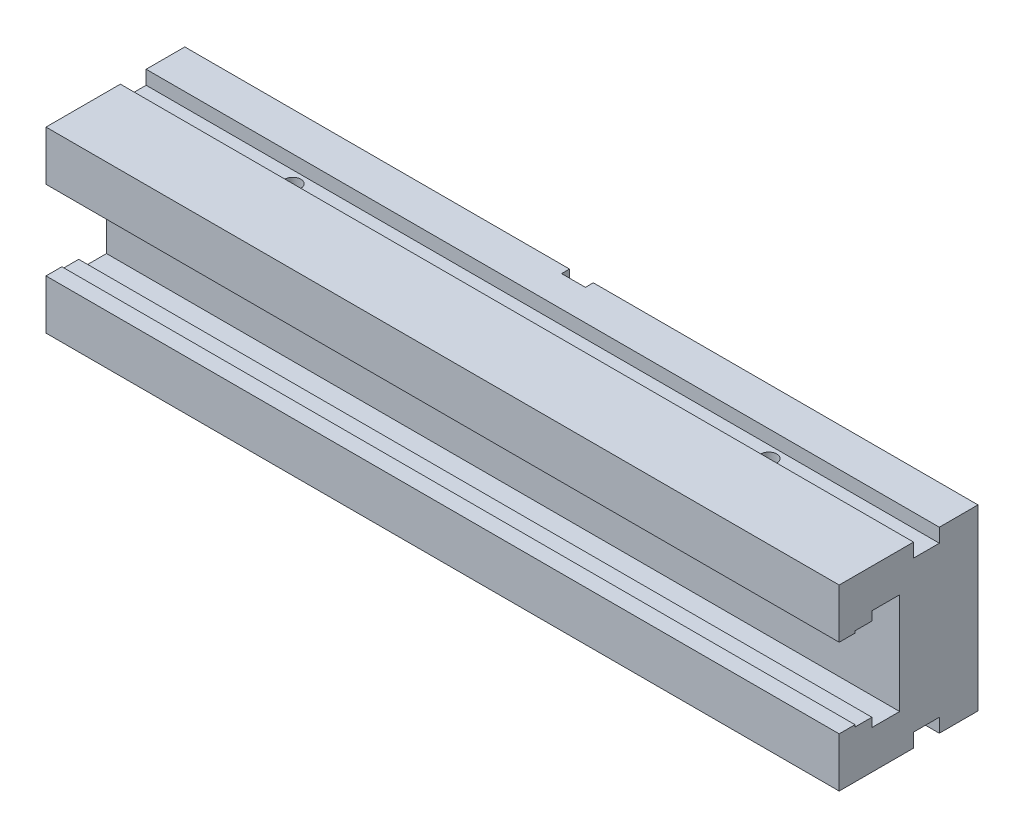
ISO-10303-21;
HEADER;
FILE_DESCRIPTION(('STEP AP214'),'2;1');
FILE_NAME('part.step','',(''),(''),'','','');
FILE_SCHEMA(('AUTOMOTIVE_DESIGN { 1 0 10303 214 1 1 1 1 }'));
ENDSEC;
DATA;
#1=APPLICATION_CONTEXT('core data for automotive mechanical design processes');
#2=APPLICATION_PROTOCOL_DEFINITION('international standard','automotive_design',2000,#1);
#3=PRODUCT_CONTEXT('',#1,'mechanical');
#4=PRODUCT('Part','Part','',(#3));
#5=PRODUCT_RELATED_PRODUCT_CATEGORY('part','',(#4));
#6=PRODUCT_DEFINITION_FORMATION('','',#4);
#7=PRODUCT_DEFINITION_CONTEXT('part definition',#1,'design');
#8=PRODUCT_DEFINITION('design','',#6,#7);
#9=PRODUCT_DEFINITION_SHAPE('','',#8);
#10=(LENGTH_UNIT() NAMED_UNIT(*) SI_UNIT(.MILLI.,.METRE.));
#11=(NAMED_UNIT(*) PLANE_ANGLE_UNIT() SI_UNIT($,.RADIAN.));
#12=(NAMED_UNIT(*) SI_UNIT($,.STERADIAN.) SOLID_ANGLE_UNIT());
#13=UNCERTAINTY_MEASURE_WITH_UNIT(LENGTH_MEASURE(1.E-05),#10,'distance_accuracy_value','');
#14=(GEOMETRIC_REPRESENTATION_CONTEXT(3) GLOBAL_UNCERTAINTY_ASSIGNED_CONTEXT((#13)) GLOBAL_UNIT_ASSIGNED_CONTEXT((#10,
#11,#12)) REPRESENTATION_CONTEXT('',''));
#15=CARTESIAN_POINT('',(0.,0.,0.));
#16=DIRECTION('',(0.,0.,1.));
#17=DIRECTION('',(1.,0.,0.));
#18=AXIS2_PLACEMENT_3D('',#15,#16,#17);
#19=CARTESIAN_POINT('',(200.,-45.,75.0883776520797));
#20=DIRECTION('',(0.,1.,0.));
#21=DIRECTION('',(0.,0.,1.));
#22=AXIS2_PLACEMENT_3D('',#19,#20,#21);
#23=PLANE('',#22);
#24=DIRECTION('',(-1.,0.,0.));
#25=VECTOR('',#24,1.);
#26=CARTESIAN_POINT('',(200.,-45.,0.));
#27=LINE('',#26,#25);
#28=CARTESIAN_POINT('',(-6.,-45.,0.));
#29=VERTEX_POINT('',#28);
#30=CARTESIAN_POINT('',(-200.,-45.,0.));
#31=VERTEX_POINT('',#30);
#32=EDGE_CURVE('E450',#29,#31,#27,.T.);
#33=ORIENTED_EDGE('',*,*,#32,.F.);
#34=DIRECTION('',(0.,0.,1.));
#35=VECTOR('',#34,1.);
#36=CARTESIAN_POINT('',(-6.,-45.,75.0883776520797));
#37=LINE('',#36,#35);
#38=CARTESIAN_POINT('',(-6.,-45.,4.));
#39=VERTEX_POINT('',#38);
#40=EDGE_CURVE('E371',#29,#39,#37,.T.);
#41=ORIENTED_EDGE('',*,*,#40,.T.);
#42=DIRECTION('',(-1.,0.,0.));
#43=VECTOR('',#42,1.);
#44=CARTESIAN_POINT('',(200.,-45.,4.));
#45=LINE('',#44,#43);
#46=CARTESIAN_POINT('',(6.,-45.,4.));
#47=VERTEX_POINT('',#46);
#48=EDGE_CURVE('E360',#47,#39,#45,.T.);
#49=ORIENTED_EDGE('',*,*,#48,.F.);
#50=DIRECTION('',(0.,0.,-1.));
#51=VECTOR('',#50,1.);
#52=CARTESIAN_POINT('',(6.,-45.,75.0883776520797));
#53=LINE('',#52,#51);
#54=CARTESIAN_POINT('',(6.,-45.,0.));
#55=VERTEX_POINT('',#54);
#56=EDGE_CURVE('E367',#47,#55,#53,.T.);
#57=ORIENTED_EDGE('',*,*,#56,.T.);
#58=CARTESIAN_POINT('',(200.,-45.,0.));
#59=VERTEX_POINT('',#58);
#60=EDGE_CURVE('E455',#59,#55,#27,.T.);
#61=ORIENTED_EDGE('',*,*,#60,.F.);
#62=DIRECTION('',(0.,0.,-1.));
#63=VECTOR('',#62,1.);
#64=CARTESIAN_POINT('',(200.,-45.,75.0883776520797));
#65=LINE('',#64,#63);
#66=CARTESIAN_POINT('',(200.,-45.,19.5));
#67=VERTEX_POINT('',#66);
#68=EDGE_CURVE('E451',#67,#59,#65,.T.);
#69=ORIENTED_EDGE('',*,*,#68,.F.);
#70=DIRECTION('',(-1.,0.,0.));
#71=VECTOR('',#70,1.);
#72=CARTESIAN_POINT('',(200.,-45.,19.5));
#73=LINE('',#72,#71);
#74=CARTESIAN_POINT('',(-200.,-45.,19.5));
#75=VERTEX_POINT('',#74);
#76=EDGE_CURVE('E23',#67,#75,#73,.T.);
#77=ORIENTED_EDGE('',*,*,#76,.T.);
#78=DIRECTION('',(0.,0.,-1.));
#79=VECTOR('',#78,1.);
#80=CARTESIAN_POINT('',(-200.,-45.,75.0883776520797));
#81=LINE('',#80,#79);
#82=EDGE_CURVE('E444',#75,#31,#81,.T.);
#83=ORIENTED_EDGE('',*,*,#82,.T.);
#84=EDGE_LOOP('',(#33,#41,#49,#57,#61,#69,#77,#83));
#85=FACE_BOUND('',#84,.T.);
#86=ADVANCED_FACE('F14',(#85),#23,.F.);
#87=CARTESIAN_POINT('',(200.,19.9992262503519,70.0001190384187));
#88=DIRECTION('',(0.,1.,0.));
#89=DIRECTION('',(0.,0.,1.));
#90=AXIS2_PLACEMENT_3D('',#87,#88,#89);
#91=PLANE('',#90);
#92=DIRECTION('',(0.,0.,-1.));
#93=VECTOR('',#92,1.);
#94=CARTESIAN_POINT('',(-200.,19.9992262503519,70.0001190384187));
#95=LINE('',#94,#93);
#96=CARTESIAN_POINT('',(-200.,19.9992262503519,70.0001190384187));
#97=VERTEX_POINT('',#96);
#98=CARTESIAN_POINT('',(-200.,19.9992262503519,62.0007380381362));
#99=VERTEX_POINT('',#98);
#100=EDGE_CURVE('E498',#97,#99,#95,.T.);
#101=ORIENTED_EDGE('',*,*,#100,.T.);
#102=DIRECTION('',(-1.,0.,0.));
#103=VECTOR('',#102,1.);
#104=CARTESIAN_POINT('',(200.,19.9992262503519,62.0007380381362));
#105=LINE('',#104,#103);
#106=CARTESIAN_POINT('',(200.,19.9992262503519,62.0007380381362));
#107=VERTEX_POINT('',#106);
#108=EDGE_CURVE('E336',#107,#99,#105,.T.);
#109=ORIENTED_EDGE('',*,*,#108,.F.);
#110=DIRECTION('',(0.,0.,-1.));
#111=VECTOR('',#110,1.);
#112=CARTESIAN_POINT('',(200.,19.9992262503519,70.0001190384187));
#113=LINE('',#112,#111);
#114=CARTESIAN_POINT('',(200.,19.9992262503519,70.0001190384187));
#115=VERTEX_POINT('',#114);
#116=EDGE_CURVE('E531',#115,#107,#113,.T.);
#117=ORIENTED_EDGE('',*,*,#116,.F.);
#118=DIRECTION('',(-1.,0.,0.));
#119=VECTOR('',#118,1.);
#120=CARTESIAN_POINT('',(200.,19.9992262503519,70.0001190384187));
#121=LINE('',#120,#119);
#122=EDGE_CURVE('E298',#115,#97,#121,.T.);
#123=ORIENTED_EDGE('',*,*,#122,.T.);
#124=EDGE_LOOP('',(#101,#109,#117,#123));
#125=FACE_BOUND('',#124,.T.);
#126=ADVANCED_FACE('F16',(#125),#91,.F.);
#127=CARTESIAN_POINT('',(200.,19.9992262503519,62.0007380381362));
#128=DIRECTION('',(0.,0.,1.));
#129=DIRECTION('',(1.,0.,0.));
#130=AXIS2_PLACEMENT_3D('',#127,#128,#129);
#131=PLANE('',#130);
#132=DIRECTION('',(0.,1.,0.));
#133=VECTOR('',#132,1.);
#134=CARTESIAN_POINT('',(-200.,19.9992262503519,62.0007380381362));
#135=LINE('',#134,#133);
#136=CARTESIAN_POINT('',(-200.,21.0003392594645,62.0007380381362));
#137=VERTEX_POINT('',#136);
#138=EDGE_CURVE('E501',#99,#137,#135,.T.);
#139=ORIENTED_EDGE('',*,*,#138,.T.);
#140=DIRECTION('',(-1.,0.,0.));
#141=VECTOR('',#140,1.);
#142=CARTESIAN_POINT('',(200.,21.0003392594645,62.0007380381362));
#143=LINE('',#142,#141);
#144=CARTESIAN_POINT('',(200.,21.0003392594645,62.0007380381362));
#145=VERTEX_POINT('',#144);
#146=EDGE_CURVE('E333',#145,#137,#143,.T.);
#147=ORIENTED_EDGE('',*,*,#146,.F.);
#148=DIRECTION('',(0.,1.,0.));
#149=VECTOR('',#148,1.);
#150=CARTESIAN_POINT('',(200.,19.9992262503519,62.0007380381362));
#151=LINE('',#150,#149);
#152=EDGE_CURVE('E534',#107,#145,#151,.T.);
#153=ORIENTED_EDGE('',*,*,#152,.F.);
#154=ORIENTED_EDGE('',*,*,#108,.T.);
#155=EDGE_LOOP('',(#139,#147,#153,#154));
#156=FACE_BOUND('',#155,.T.);
#157=ADVANCED_FACE('F725',(#156),#131,.F.);
#158=CARTESIAN_POINT('',(200.,21.0003392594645,53.5002053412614));
#159=DIRECTION('',(0.,1.,0.));
#160=DIRECTION('',(-1.,0.,0.));
#161=AXIS2_PLACEMENT_3D('',#158,#159,#160);
#162=PLANE('',#161);
#163=DIRECTION('',(0.,0.,-1.));
#164=VECTOR('',#163,1.);
#165=CARTESIAN_POINT('',(-200.,21.0003392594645,53.5002053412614));
#166=LINE('',#165,#164);
#167=CARTESIAN_POINT('',(-200.,21.0003392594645,53.5002053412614));
#168=VERTEX_POINT('',#167);
#169=EDGE_CURVE('E503',#137,#168,#166,.T.);
#170=ORIENTED_EDGE('',*,*,#169,.T.);
#171=DIRECTION('',(-1.,0.,0.));
#172=VECTOR('',#171,1.);
#173=CARTESIAN_POINT('',(200.,21.0003392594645,53.5002053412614));
#174=LINE('',#173,#172);
#175=CARTESIAN_POINT('',(200.,21.0003392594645,53.5002053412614));
#176=VERTEX_POINT('',#175);
#177=EDGE_CURVE('E330',#176,#168,#174,.T.);
#178=ORIENTED_EDGE('',*,*,#177,.F.);
#179=DIRECTION('',(0.,0.,-1.));
#180=VECTOR('',#179,1.);
#181=CARTESIAN_POINT('',(200.,21.0003392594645,53.5002053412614));
#182=LINE('',#181,#180);
#183=EDGE_CURVE('E536',#145,#176,#182,.T.);
#184=ORIENTED_EDGE('',*,*,#183,.F.);
#185=ORIENTED_EDGE('',*,*,#146,.T.);
#186=EDGE_LOOP('',(#170,#178,#184,#185));
#187=FACE_BOUND('',#186,.T.);
#188=ADVANCED_FACE('F825',(#187),#162,.F.);
#189=CARTESIAN_POINT('',(200.,21.0003392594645,53.5002053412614));
#190=DIRECTION('',(0.,0.,1.));
#191=DIRECTION('',(1.,0.,0.));
#192=AXIS2_PLACEMENT_3D('',#189,#190,#191);
#193=PLANE('',#192);
#194=DIRECTION('',(0.,1.,0.));
#195=VECTOR('',#194,1.);
#196=CARTESIAN_POINT('',(-200.,21.0003392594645,53.5002053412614));
#197=LINE('',#196,#195);
#198=CARTESIAN_POINT('',(-200.,25.4999910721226,53.5002053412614));
#199=VERTEX_POINT('',#198);
#200=EDGE_CURVE('E505',#168,#199,#197,.T.);
#201=ORIENTED_EDGE('',*,*,#200,.T.);
#202=DIRECTION('',(-1.,0.,0.));
#203=VECTOR('',#202,1.);
#204=CARTESIAN_POINT('',(200.,25.4999910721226,53.5002053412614));
#205=LINE('',#204,#203);
#206=CARTESIAN_POINT('',(200.,25.4999910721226,53.5002053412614));
#207=VERTEX_POINT('',#206);
#208=EDGE_CURVE('E327',#207,#199,#205,.T.);
#209=ORIENTED_EDGE('',*,*,#208,.F.);
#210=DIRECTION('',(0.,1.,0.));
#211=VECTOR('',#210,1.);
#212=CARTESIAN_POINT('',(200.,21.0003392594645,53.5002053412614));
#213=LINE('',#212,#211);
#214=EDGE_CURVE('E538',#176,#207,#213,.T.);
#215=ORIENTED_EDGE('',*,*,#214,.F.);
#216=ORIENTED_EDGE('',*,*,#177,.T.);
#217=EDGE_LOOP('',(#201,#209,#215,#216));
#218=FACE_BOUND('',#217,.T.);
#219=ADVANCED_FACE('F821',(#218),#193,.F.);
#220=CARTESIAN_POINT('',(200.,25.4999910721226,53.5002053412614));
#221=DIRECTION('',(0.,1.,0.));
#222=DIRECTION('',(-1.,0.,0.));
#223=AXIS2_PLACEMENT_3D('',#220,#221,#222);
#224=PLANE('',#223);
#225=DIRECTION('',(0.,0.,-1.));
#226=VECTOR('',#225,1.);
#227=CARTESIAN_POINT('',(-200.,25.4999910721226,53.5002053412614));
#228=LINE('',#227,#226);
#229=CARTESIAN_POINT('',(-200.,25.4999910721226,39.4999434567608));
#230=VERTEX_POINT('',#229);
#231=EDGE_CURVE('E507',#199,#230,#228,.T.);
#232=ORIENTED_EDGE('',*,*,#231,.T.);
#233=DIRECTION('',(-1.,0.,0.));
#234=VECTOR('',#233,1.);
#235=CARTESIAN_POINT('',(200.,25.4999910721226,39.4999434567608));
#236=LINE('',#235,#234);
#237=CARTESIAN_POINT('',(200.,25.4999910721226,39.4999434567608));
#238=VERTEX_POINT('',#237);
#239=EDGE_CURVE('E324',#238,#230,#236,.T.);
#240=ORIENTED_EDGE('',*,*,#239,.F.);
#241=DIRECTION('',(0.,0.,-1.));
#242=VECTOR('',#241,1.);
#243=CARTESIAN_POINT('',(200.,25.4999910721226,53.5002053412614));
#244=LINE('',#243,#242);
#245=EDGE_CURVE('E540',#207,#238,#244,.T.);
#246=ORIENTED_EDGE('',*,*,#245,.F.);
#247=ORIENTED_EDGE('',*,*,#208,.T.);
#248=EDGE_LOOP('',(#232,#240,#246,#247));
#249=FACE_BOUND('',#248,.T.);
#250=ADVANCED_FACE('F817',(#249),#224,.F.);
#251=CARTESIAN_POINT('',(200.,25.4999910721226,39.4999434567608));
#252=DIRECTION('',(0.,0.,-1.));
#253=DIRECTION('',(-1.,0.,0.));
#254=AXIS2_PLACEMENT_3D('',#251,#252,#253);
#255=PLANE('',#254);
#256=CARTESIAN_POINT('',(-100.,0.,39.4999434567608));
#257=DIRECTION('',(0.,0.,1.));
#258=DIRECTION('',(1.,0.,0.));
#259=AXIS2_PLACEMENT_3D('',#256,#257,#258);
#260=CIRCLE('',#259,9.5);
#261=CARTESIAN_POINT('',(-90.5,0.,39.4999434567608));
#262=VERTEX_POINT('',#261);
#263=EDGE_CURVE('E474',#262,#262,#260,.T.);
#264=ORIENTED_EDGE('',*,*,#263,.F.);
#265=EDGE_LOOP('',(#264));
#266=FACE_BOUND('',#265,.T.);
#267=CARTESIAN_POINT('',(100.,0.,39.4999434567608));
#268=DIRECTION('',(0.,0.,1.));
#269=DIRECTION('',(1.,0.,0.));
#270=AXIS2_PLACEMENT_3D('',#267,#268,#269);
#271=CIRCLE('',#270,9.5);
#272=CARTESIAN_POINT('',(109.5,0.,39.4999434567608));
#273=VERTEX_POINT('',#272);
#274=EDGE_CURVE('E486',#273,#273,#271,.T.);
#275=ORIENTED_EDGE('',*,*,#274,.F.);
#276=EDGE_LOOP('',(#275));
#277=FACE_BOUND('',#276,.T.);
#278=CARTESIAN_POINT('',(0.,0.,39.4999434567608));
#279=DIRECTION('',(0.,0.,1.));
#280=DIRECTION('',(1.,0.,0.));
#281=AXIS2_PLACEMENT_3D('',#278,#279,#280);
#282=CIRCLE('',#281,9.5);
#283=CARTESIAN_POINT('',(9.5,0.,39.4999434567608));
#284=VERTEX_POINT('',#283);
#285=EDGE_CURVE('E495',#284,#284,#282,.T.);
#286=ORIENTED_EDGE('',*,*,#285,.F.);
#287=EDGE_LOOP('',(#286));
#288=FACE_BOUND('',#287,.T.);
#289=DIRECTION('',(0.,-1.,0.));
#290=VECTOR('',#289,1.);
#291=CARTESIAN_POINT('',(-200.,25.4999910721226,39.4999434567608));
#292=LINE('',#291,#290);
#293=CARTESIAN_POINT('',(-200.,-25.4999910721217,39.4999434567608));
#294=VERTEX_POINT('',#293);
#295=EDGE_CURVE('E509',#230,#294,#292,.T.);
#296=ORIENTED_EDGE('',*,*,#295,.T.);
#297=DIRECTION('',(-1.,0.,0.));
#298=VECTOR('',#297,1.);
#299=CARTESIAN_POINT('',(200.,-25.4999910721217,39.4999434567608));
#300=LINE('',#299,#298);
#301=CARTESIAN_POINT('',(200.,-25.4999910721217,39.4999434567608));
#302=VERTEX_POINT('',#301);
#303=EDGE_CURVE('E321',#302,#294,#300,.T.);
#304=ORIENTED_EDGE('',*,*,#303,.F.);
#305=DIRECTION('',(0.,-1.,0.));
#306=VECTOR('',#305,1.);
#307=CARTESIAN_POINT('',(200.,25.4999910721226,39.4999434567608));
#308=LINE('',#307,#306);
#309=EDGE_CURVE('E542',#238,#302,#308,.T.);
#310=ORIENTED_EDGE('',*,*,#309,.F.);
#311=ORIENTED_EDGE('',*,*,#239,.T.);
#312=EDGE_LOOP('',(#296,#304,#310,#311));
#313=FACE_BOUND('',#312,.T.);
#314=ADVANCED_FACE('F813',(#266,#277,#288,#313),#255,.F.);
#315=CARTESIAN_POINT('',(200.,-25.4999910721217,39.4999434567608));
#316=DIRECTION('',(0.,-1.,0.));
#317=DIRECTION('',(1.,0.,0.));
#318=AXIS2_PLACEMENT_3D('',#315,#316,#317);
#319=PLANE('',#318);
#320=DIRECTION('',(0.,0.,1.));
#321=VECTOR('',#320,1.);
#322=CARTESIAN_POINT('',(-200.,-25.4999910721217,39.4999434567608));
#323=LINE('',#322,#321);
#324=CARTESIAN_POINT('',(-200.,-25.4999910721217,53.5002053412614));
#325=VERTEX_POINT('',#324);
#326=EDGE_CURVE('E511',#294,#325,#323,.T.);
#327=ORIENTED_EDGE('',*,*,#326,.T.);
#328=DIRECTION('',(-1.,0.,0.));
#329=VECTOR('',#328,1.);
#330=CARTESIAN_POINT('',(200.,-25.4999910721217,53.5002053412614));
#331=LINE('',#330,#329);
#332=CARTESIAN_POINT('',(200.,-25.4999910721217,53.5002053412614));
#333=VERTEX_POINT('',#332);
#334=EDGE_CURVE('E318',#333,#325,#331,.T.);
#335=ORIENTED_EDGE('',*,*,#334,.F.);
#336=DIRECTION('',(0.,0.,1.));
#337=VECTOR('',#336,1.);
#338=CARTESIAN_POINT('',(200.,-25.4999910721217,39.4999434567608));
#339=LINE('',#338,#337);
#340=EDGE_CURVE('E544',#302,#333,#339,.T.);
#341=ORIENTED_EDGE('',*,*,#340,.F.);
#342=ORIENTED_EDGE('',*,*,#303,.T.);
#343=EDGE_LOOP('',(#327,#335,#341,#342));
#344=FACE_BOUND('',#343,.T.);
#345=ADVANCED_FACE('F809',(#344),#319,.F.);
#346=CARTESIAN_POINT('',(200.,-25.4999910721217,53.5002053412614));
#347=DIRECTION('',(0.,0.,1.));
#348=DIRECTION('',(1.,0.,0.));
#349=AXIS2_PLACEMENT_3D('',#346,#347,#348);
#350=PLANE('',#349);
#351=DIRECTION('',(0.,1.,0.));
#352=VECTOR('',#351,1.);
#353=CARTESIAN_POINT('',(-200.,-25.4999910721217,53.5002053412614));
#354=LINE('',#353,#352);
#355=CARTESIAN_POINT('',(-200.,-21.0003392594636,53.5002053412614));
#356=VERTEX_POINT('',#355);
#357=EDGE_CURVE('E513',#325,#356,#354,.T.);
#358=ORIENTED_EDGE('',*,*,#357,.T.);
#359=DIRECTION('',(-1.,0.,0.));
#360=VECTOR('',#359,1.);
#361=CARTESIAN_POINT('',(200.,-21.0003392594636,53.5002053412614));
#362=LINE('',#361,#360);
#363=CARTESIAN_POINT('',(200.,-21.0003392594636,53.5002053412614));
#364=VERTEX_POINT('',#363);
#365=EDGE_CURVE('E315',#364,#356,#362,.T.);
#366=ORIENTED_EDGE('',*,*,#365,.F.);
#367=DIRECTION('',(0.,1.,0.));
#368=VECTOR('',#367,1.);
#369=CARTESIAN_POINT('',(200.,-25.4999910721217,53.5002053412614));
#370=LINE('',#369,#368);
#371=EDGE_CURVE('E546',#333,#364,#370,.T.);
#372=ORIENTED_EDGE('',*,*,#371,.F.);
#373=ORIENTED_EDGE('',*,*,#334,.T.);
#374=EDGE_LOOP('',(#358,#366,#372,#373));
#375=FACE_BOUND('',#374,.T.);
#376=ADVANCED_FACE('F805',(#375),#350,.F.);
#377=CARTESIAN_POINT('',(200.,-21.0003392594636,53.5002053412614));
#378=DIRECTION('',(0.,-1.,0.));
#379=DIRECTION('',(1.,0.,0.));
#380=AXIS2_PLACEMENT_3D('',#377,#378,#379);
#381=PLANE('',#380);
#382=DIRECTION('',(0.,0.,1.));
#383=VECTOR('',#382,1.);
#384=CARTESIAN_POINT('',(-200.,-21.0003392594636,53.5002053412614));
#385=LINE('',#384,#383);
#386=CARTESIAN_POINT('',(-200.,-21.0003392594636,62.0007380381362));
#387=VERTEX_POINT('',#386);
#388=EDGE_CURVE('E515',#356,#387,#385,.T.);
#389=ORIENTED_EDGE('',*,*,#388,.T.);
#390=DIRECTION('',(-1.,0.,0.));
#391=VECTOR('',#390,1.);
#392=CARTESIAN_POINT('',(200.,-21.0003392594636,62.0007380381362));
#393=LINE('',#392,#391);
#394=CARTESIAN_POINT('',(200.,-21.0003392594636,62.0007380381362));
#395=VERTEX_POINT('',#394);
#396=EDGE_CURVE('E312',#395,#387,#393,.T.);
#397=ORIENTED_EDGE('',*,*,#396,.F.);
#398=DIRECTION('',(0.,0.,1.));
#399=VECTOR('',#398,1.);
#400=CARTESIAN_POINT('',(200.,-21.0003392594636,53.5002053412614));
#401=LINE('',#400,#399);
#402=EDGE_CURVE('E548',#364,#395,#401,.T.);
#403=ORIENTED_EDGE('',*,*,#402,.F.);
#404=ORIENTED_EDGE('',*,*,#365,.T.);
#405=EDGE_LOOP('',(#389,#397,#403,#404));
#406=FACE_BOUND('',#405,.T.);
#407=ADVANCED_FACE('F801',(#406),#381,.F.);
#408=CARTESIAN_POINT('',(200.,-20.0004166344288,62.0007380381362));
#409=DIRECTION('',(0.,0.,1.));
#410=DIRECTION('',(1.,0.,0.));
#411=AXIS2_PLACEMENT_3D('',#408,#409,#410);
#412=PLANE('',#411);
#413=DIRECTION('',(0.,1.,0.));
#414=VECTOR('',#413,1.);
#415=CARTESIAN_POINT('',(-200.,-20.0004166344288,62.0007380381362));
#416=LINE('',#415,#414);
#417=CARTESIAN_POINT('',(-200.,-20.0004166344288,62.0007380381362));
#418=VERTEX_POINT('',#417);
#419=EDGE_CURVE('E517',#387,#418,#416,.T.);
#420=ORIENTED_EDGE('',*,*,#419,.T.);
#421=DIRECTION('',(-1.,0.,0.));
#422=VECTOR('',#421,1.);
#423=CARTESIAN_POINT('',(200.,-20.0004166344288,62.0007380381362));
#424=LINE('',#423,#422);
#425=CARTESIAN_POINT('',(200.,-20.0004166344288,62.0007380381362));
#426=VERTEX_POINT('',#425);
#427=EDGE_CURVE('E309',#426,#418,#424,.T.);
#428=ORIENTED_EDGE('',*,*,#427,.F.);
#429=DIRECTION('',(0.,1.,0.));
#430=VECTOR('',#429,1.);
#431=CARTESIAN_POINT('',(200.,-20.0004166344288,62.0007380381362));
#432=LINE('',#431,#430);
#433=EDGE_CURVE('E550',#395,#426,#432,.T.);
#434=ORIENTED_EDGE('',*,*,#433,.F.);
#435=ORIENTED_EDGE('',*,*,#396,.T.);
#436=EDGE_LOOP('',(#420,#428,#434,#435));
#437=FACE_BOUND('',#436,.T.);
#438=ADVANCED_FACE('F797',(#437),#412,.F.);
#439=CARTESIAN_POINT('',(200.,-20.0004166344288,62.0007380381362));
#440=DIRECTION('',(0.,-1.,0.));
#441=DIRECTION('',(1.,0.,0.));
#442=AXIS2_PLACEMENT_3D('',#439,#440,#441);
#443=PLANE('',#442);
#444=DIRECTION('',(0.,0.,1.));
#445=VECTOR('',#444,1.);
#446=CARTESIAN_POINT('',(-200.,-20.0004166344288,62.0007380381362));
#447=LINE('',#446,#445);
#448=CARTESIAN_POINT('',(-200.,-20.0004166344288,70.0001190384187));
#449=VERTEX_POINT('',#448);
#450=EDGE_CURVE('E519',#418,#449,#447,.T.);
#451=ORIENTED_EDGE('',*,*,#450,.T.);
#452=DIRECTION('',(-1.,0.,0.));
#453=VECTOR('',#452,1.);
#454=CARTESIAN_POINT('',(200.,-20.0004166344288,70.0001190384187));
#455=LINE('',#454,#453);
#456=CARTESIAN_POINT('',(200.,-20.0004166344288,70.0001190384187));
#457=VERTEX_POINT('',#456);
#458=EDGE_CURVE('E306',#457,#449,#455,.T.);
#459=ORIENTED_EDGE('',*,*,#458,.F.);
#460=DIRECTION('',(0.,0.,1.));
#461=VECTOR('',#460,1.);
#462=CARTESIAN_POINT('',(200.,-20.0004166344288,62.0007380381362));
#463=LINE('',#462,#461);
#464=EDGE_CURVE('E552',#426,#457,#463,.T.);
#465=ORIENTED_EDGE('',*,*,#464,.F.);
#466=ORIENTED_EDGE('',*,*,#427,.T.);
#467=EDGE_LOOP('',(#451,#459,#465,#466));
#468=FACE_BOUND('',#467,.T.);
#469=ADVANCED_FACE('F794',(#468),#443,.F.);
#470=CARTESIAN_POINT('',(200.,-45.0012499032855,70.0001190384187));
#471=DIRECTION('',(0.,0.,-1.));
#472=DIRECTION('',(-1.,0.,0.));
#473=AXIS2_PLACEMENT_3D('',#470,#471,#472);
#474=PLANE('',#473);
#475=DIRECTION('',(0.,-1.,0.));
#476=VECTOR('',#475,1.);
#477=CARTESIAN_POINT('',(-200.,-45.0012499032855,70.0001190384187));
#478=LINE('',#477,#476);
#479=CARTESIAN_POINT('',(-200.,-45.,70.0001190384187));
#480=VERTEX_POINT('',#479);
#481=EDGE_CURVE('E521',#449,#480,#478,.T.);
#482=ORIENTED_EDGE('',*,*,#481,.T.);
#483=DIRECTION('',(1.,0.,0.));
#484=VECTOR('',#483,1.);
#485=CARTESIAN_POINT('',(200.,-45.,70.0001190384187));
#486=LINE('',#485,#484);
#487=CARTESIAN_POINT('',(200.,-45.,70.0001190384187));
#488=VERTEX_POINT('',#487);
#489=EDGE_CURVE('E457',#480,#488,#486,.T.);
#490=ORIENTED_EDGE('',*,*,#489,.T.);
#491=DIRECTION('',(0.,-1.,0.));
#492=VECTOR('',#491,1.);
#493=CARTESIAN_POINT('',(200.,-45.0012499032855,70.0001190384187));
#494=LINE('',#493,#492);
#495=EDGE_CURVE('E300',#457,#488,#494,.T.);
#496=ORIENTED_EDGE('',*,*,#495,.F.);
#497=ORIENTED_EDGE('',*,*,#458,.T.);
#498=EDGE_LOOP('',(#482,#490,#496,#497));
#499=FACE_BOUND('',#498,.T.);
#500=ADVANCED_FACE('F558',(#499),#474,.F.);
#501=CARTESIAN_POINT('',(200.,45.0000595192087,0.));
#502=DIRECTION('',(0.,0.,1.));
#503=DIRECTION('',(1.,0.,0.));
#504=AXIS2_PLACEMENT_3D('',#501,#502,#503);
#505=PLANE('',#504);
#506=DIRECTION('',(-1.,0.,0.));
#507=VECTOR('',#506,1.);
#508=CARTESIAN_POINT('',(-120.,-6.,0.));
#509=LINE('',#508,#507);
#510=CARTESIAN_POINT('',(-120.,-6.,0.));
#511=VERTEX_POINT('',#510);
#512=CARTESIAN_POINT('',(-150.,-6.,0.));
#513=VERTEX_POINT('',#512);
#514=EDGE_CURVE('E621',#511,#513,#509,.T.);
#515=ORIENTED_EDGE('',*,*,#514,.F.);
#516=CARTESIAN_POINT('',(-120.,0.,0.));
#517=DIRECTION('',(0.,0.,-1.));
#518=DIRECTION('',(-1.,0.,0.));
#519=AXIS2_PLACEMENT_3D('',#516,#517,#518);
#520=CIRCLE('',#519,6.);
#521=CARTESIAN_POINT('',(-120.,6.,0.));
#522=VERTEX_POINT('',#521);
#523=EDGE_CURVE('E619',#522,#511,#520,.T.);
#524=ORIENTED_EDGE('',*,*,#523,.F.);
#525=DIRECTION('',(1.,0.,0.));
#526=VECTOR('',#525,1.);
#527=CARTESIAN_POINT('',(-120.,6.,0.));
#528=LINE('',#527,#526);
#529=CARTESIAN_POINT('',(-150.,6.,0.));
#530=VERTEX_POINT('',#529);
#531=EDGE_CURVE('E609',#530,#522,#528,.T.);
#532=ORIENTED_EDGE('',*,*,#531,.F.);
#533=CARTESIAN_POINT('',(-150.,0.,0.));
#534=DIRECTION('',(0.,0.,-1.));
#535=DIRECTION('',(-1.,0.,0.));
#536=AXIS2_PLACEMENT_3D('',#533,#534,#535);
#537=CIRCLE('',#536,6.);
#538=EDGE_CURVE('E625',#513,#530,#537,.T.);
#539=ORIENTED_EDGE('',*,*,#538,.F.);
#540=EDGE_LOOP('',(#515,#524,#532,#539));
#541=FACE_BOUND('',#540,.T.);
#542=DIRECTION('',(1.,0.,0.));
#543=VECTOR('',#542,1.);
#544=CARTESIAN_POINT('',(120.,6.,0.));
#545=LINE('',#544,#543);
#546=CARTESIAN_POINT('',(120.,6.,0.));
#547=VERTEX_POINT('',#546);
#548=CARTESIAN_POINT('',(150.,6.,0.));
#549=VERTEX_POINT('',#548);
#550=EDGE_CURVE('E398',#547,#549,#545,.T.);
#551=ORIENTED_EDGE('',*,*,#550,.F.);
#552=CARTESIAN_POINT('',(120.,0.,0.));
#553=DIRECTION('',(0.,0.,-1.));
#554=DIRECTION('',(-1.,0.,0.));
#555=AXIS2_PLACEMENT_3D('',#552,#553,#554);
#556=CIRCLE('',#555,6.);
#557=CARTESIAN_POINT('',(120.,-6.,0.));
#558=VERTEX_POINT('',#557);
#559=EDGE_CURVE('E378',#558,#547,#556,.T.);
#560=ORIENTED_EDGE('',*,*,#559,.F.);
#561=DIRECTION('',(-1.,0.,0.));
#562=VECTOR('',#561,1.);
#563=CARTESIAN_POINT('',(120.,-6.,0.));
#564=LINE('',#563,#562);
#565=CARTESIAN_POINT('',(150.,-6.,0.));
#566=VERTEX_POINT('',#565);
#567=EDGE_CURVE('E387',#566,#558,#564,.T.);
#568=ORIENTED_EDGE('',*,*,#567,.F.);
#569=CARTESIAN_POINT('',(150.,0.,0.));
#570=DIRECTION('',(0.,0.,-1.));
#571=DIRECTION('',(-1.,0.,0.));
#572=AXIS2_PLACEMENT_3D('',#569,#570,#571);
#573=CIRCLE('',#572,6.);
#574=EDGE_CURVE('E401',#549,#566,#573,.T.);
#575=ORIENTED_EDGE('',*,*,#574,.F.);
#576=EDGE_LOOP('',(#551,#560,#568,#575));
#577=FACE_BOUND('',#576,.T.);
#578=DIRECTION('',(0.,1.,0.));
#579=VECTOR('',#578,1.);
#580=CARTESIAN_POINT('',(-200.,45.0000595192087,0.));
#581=LINE('',#580,#579);
#582=CARTESIAN_POINT('',(-200.,45.,0.));
#583=VERTEX_POINT('',#582);
#584=EDGE_CURVE('E524',#31,#583,#581,.T.);
#585=ORIENTED_EDGE('',*,*,#584,.T.);
#586=DIRECTION('',(1.,0.,0.));
#587=VECTOR('',#586,1.);
#588=CARTESIAN_POINT('',(200.,45.,0.));
#589=LINE('',#588,#587);
#590=CARTESIAN_POINT('',(-6.,45.,0.));
#591=VERTEX_POINT('',#590);
#592=EDGE_CURVE('E591',#583,#591,#589,.T.);
#593=ORIENTED_EDGE('',*,*,#592,.T.);
#594=DIRECTION('',(0.,1.,0.));
#595=VECTOR('',#594,1.);
#596=CARTESIAN_POINT('',(-6.,17.5,0.));
#597=LINE('',#596,#595);
#598=CARTESIAN_POINT('',(-6.,17.5,0.));
#599=VERTEX_POINT('',#598);
#600=EDGE_CURVE('E667',#599,#591,#597,.T.);
#601=ORIENTED_EDGE('',*,*,#600,.F.);
#602=CARTESIAN_POINT('',(0.,17.5,0.));
#603=DIRECTION('',(0.,0.,-1.));
#604=DIRECTION('',(-1.,0.,0.));
#605=AXIS2_PLACEMENT_3D('',#602,#603,#604);
#606=CIRCLE('',#605,6.);
#607=CARTESIAN_POINT('',(6.,17.5,0.));
#608=VERTEX_POINT('',#607);
#609=EDGE_CURVE('E604',#608,#599,#606,.T.);
#610=ORIENTED_EDGE('',*,*,#609,.F.);
#611=DIRECTION('',(0.,-1.,0.));
#612=VECTOR('',#611,1.);
#613=CARTESIAN_POINT('',(6.,17.5,0.));
#614=LINE('',#613,#612);
#615=CARTESIAN_POINT('',(6.,45.,0.));
#616=VERTEX_POINT('',#615);
#617=EDGE_CURVE('E590',#616,#608,#614,.T.);
#618=ORIENTED_EDGE('',*,*,#617,.F.);
#619=CARTESIAN_POINT('',(200.,45.,0.));
#620=VERTEX_POINT('',#619);
#621=EDGE_CURVE('E588',#616,#620,#589,.T.);
#622=ORIENTED_EDGE('',*,*,#621,.T.);
#623=DIRECTION('',(0.,1.,0.));
#624=VECTOR('',#623,1.);
#625=CARTESIAN_POINT('',(200.,45.0000595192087,0.));
#626=LINE('',#625,#624);
#627=EDGE_CURVE('E289',#59,#620,#626,.T.);
#628=ORIENTED_EDGE('',*,*,#627,.F.);
#629=ORIENTED_EDGE('',*,*,#60,.T.);
#630=DIRECTION('',(0.,-1.,0.));
#631=VECTOR('',#630,1.);
#632=CARTESIAN_POINT('',(6.,-17.5,0.));
#633=LINE('',#632,#631);
#634=CARTESIAN_POINT('',(6.,-17.5,0.));
#635=VERTEX_POINT('',#634);
#636=EDGE_CURVE('E586',#635,#55,#633,.T.);
#637=ORIENTED_EDGE('',*,*,#636,.F.);
#638=CARTESIAN_POINT('',(0.,-17.5,0.));
#639=DIRECTION('',(0.,0.,-1.));
#640=DIRECTION('',(-1.,0.,0.));
#641=AXIS2_PLACEMENT_3D('',#638,#639,#640);
#642=CIRCLE('',#641,6.);
#643=CARTESIAN_POINT('',(-6.,-17.5,0.));
#644=VERTEX_POINT('',#643);
#645=EDGE_CURVE('E647',#644,#635,#642,.T.);
#646=ORIENTED_EDGE('',*,*,#645,.F.);
#647=DIRECTION('',(0.,1.,0.));
#648=VECTOR('',#647,1.);
#649=CARTESIAN_POINT('',(-6.,-17.5,0.));
#650=LINE('',#649,#648);
#651=EDGE_CURVE('E641',#29,#644,#650,.T.);
#652=ORIENTED_EDGE('',*,*,#651,.F.);
#653=ORIENTED_EDGE('',*,*,#32,.T.);
#654=EDGE_LOOP('',(#585,#593,#601,#610,#618,#622,#628,#629,#637,#646,#652,#653));
#655=FACE_BOUND('',#654,.T.);
#656=CARTESIAN_POINT('',(0.,0.,0.));
#657=DIRECTION('',(0.,0.,-1.));
#658=DIRECTION('',(-1.,0.,0.));
#659=AXIS2_PLACEMENT_3D('',#656,#657,#658);
#660=CIRCLE('',#659,6.5);
#661=CARTESIAN_POINT('',(-6.5,0.,0.));
#662=VERTEX_POINT('',#661);
#663=EDGE_CURVE('E351',#662,#662,#660,.T.);
#664=ORIENTED_EDGE('',*,*,#663,.F.);
#665=EDGE_LOOP('',(#664));
#666=FACE_BOUND('',#665,.T.);
#667=CARTESIAN_POINT('',(-100.,0.,-4.27435864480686E-11));
#668=DIRECTION('',(0.,0.,1.));
#669=DIRECTION('',(1.,0.,0.));
#670=AXIS2_PLACEMENT_3D('',#667,#668,#669);
#671=CIRCLE('',#670,6.5);
#672=CARTESIAN_POINT('',(-93.5,0.,-4.27435864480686E-11));
#673=VERTEX_POINT('',#672);
#674=EDGE_CURVE('E465',#673,#673,#671,.T.);
#675=ORIENTED_EDGE('',*,*,#674,.T.);
#676=EDGE_LOOP('',(#675));
#677=FACE_BOUND('',#676,.T.);
#678=CARTESIAN_POINT('',(100.,0.,-4.27435864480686E-11));
#679=DIRECTION('',(0.,0.,1.));
#680=DIRECTION('',(1.,0.,0.));
#681=AXIS2_PLACEMENT_3D('',#678,#679,#680);
#682=CIRCLE('',#681,6.5);
#683=CARTESIAN_POINT('',(106.5,0.,-4.27435864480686E-11));
#684=VERTEX_POINT('',#683);
#685=EDGE_CURVE('E477',#684,#684,#682,.T.);
#686=ORIENTED_EDGE('',*,*,#685,.T.);
#687=EDGE_LOOP('',(#686));
#688=FACE_BOUND('',#687,.T.);
#689=ADVANCED_FACE('F583',(#541,#577,#655,#666,#677,#688),#505,.F.);
#690=CARTESIAN_POINT('',(200.,45.0000595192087,19.5));
#691=DIRECTION('',(0.,0.,-1.));
#692=DIRECTION('',(-1.,0.,0.));
#693=AXIS2_PLACEMENT_3D('',#690,#691,#692);
#694=PLANE('',#693);
#695=DIRECTION('',(0.,-1.,0.));
#696=VECTOR('',#695,1.);
#697=CARTESIAN_POINT('',(200.,45.0000595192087,19.5));
#698=LINE('',#697,#696);
#699=CARTESIAN_POINT('',(200.,45.,19.5));
#700=VERTEX_POINT('',#699);
#701=CARTESIAN_POINT('',(200.,38.,19.5));
#702=VERTEX_POINT('',#701);
#703=EDGE_CURVE('E286',#700,#702,#698,.T.);
#704=ORIENTED_EDGE('',*,*,#703,.F.);
#705=DIRECTION('',(-1.,0.,0.));
#706=VECTOR('',#705,1.);
#707=CARTESIAN_POINT('',(200.,45.,19.5));
#708=LINE('',#707,#706);
#709=CARTESIAN_POINT('',(-200.,45.,19.5));
#710=VERTEX_POINT('',#709);
#711=EDGE_CURVE('E269',#700,#710,#708,.T.);
#712=ORIENTED_EDGE('',*,*,#711,.T.);
#713=DIRECTION('',(0.,-1.,0.));
#714=VECTOR('',#713,1.);
#715=CARTESIAN_POINT('',(-200.,45.0000595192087,19.5));
#716=LINE('',#715,#714);
#717=CARTESIAN_POINT('',(-200.,38.,19.5));
#718=VERTEX_POINT('',#717);
#719=EDGE_CURVE('E527',#710,#718,#716,.T.);
#720=ORIENTED_EDGE('',*,*,#719,.T.);
#721=DIRECTION('',(-1.,0.,0.));
#722=VECTOR('',#721,1.);
#723=CARTESIAN_POINT('',(200.,38.,19.5));
#724=LINE('',#723,#722);
#725=EDGE_CURVE('E279',#702,#718,#724,.T.);
#726=ORIENTED_EDGE('',*,*,#725,.F.);
#727=EDGE_LOOP('',(#704,#712,#720,#726));
#728=FACE_BOUND('',#727,.T.);
#729=ADVANCED_FACE('F293',(#728),#694,.F.);
#730=CARTESIAN_POINT('',(200.,19.9992262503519,70.0001190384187));
#731=DIRECTION('',(0.,0.,-1.));
#732=DIRECTION('',(-1.,0.,0.));
#733=AXIS2_PLACEMENT_3D('',#730,#731,#732);
#734=PLANE('',#733);
#735=DIRECTION('',(0.,-1.,0.));
#736=VECTOR('',#735,1.);
#737=CARTESIAN_POINT('',(200.,19.9992262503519,70.0001190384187));
#738=LINE('',#737,#736);
#739=CARTESIAN_POINT('',(200.,45.,70.0001190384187));
#740=VERTEX_POINT('',#739);
#741=EDGE_CURVE('E296',#740,#115,#738,.T.);
#742=ORIENTED_EDGE('',*,*,#741,.F.);
#743=DIRECTION('',(-1.,0.,0.));
#744=VECTOR('',#743,1.);
#745=CARTESIAN_POINT('',(200.,45.,70.0001190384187));
#746=LINE('',#745,#744);
#747=CARTESIAN_POINT('',(-200.,45.,70.0001190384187));
#748=VERTEX_POINT('',#747);
#749=EDGE_CURVE('E601',#740,#748,#746,.T.);
#750=ORIENTED_EDGE('',*,*,#749,.T.);
#751=DIRECTION('',(0.,-1.,0.));
#752=VECTOR('',#751,1.);
#753=CARTESIAN_POINT('',(-200.,19.9992262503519,70.0001190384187));
#754=LINE('',#753,#752);
#755=EDGE_CURVE('E529',#748,#97,#754,.T.);
#756=ORIENTED_EDGE('',*,*,#755,.T.);
#757=ORIENTED_EDGE('',*,*,#122,.F.);
#758=EDGE_LOOP('',(#742,#750,#756,#757));
#759=FACE_BOUND('',#758,.T.);
#760=ADVANCED_FACE('F783',(#759),#734,.F.);
#761=CARTESIAN_POINT('',(200.,19.9992262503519,0.));
#762=DIRECTION('',(-1.,0.,0.));
#763=DIRECTION('',(0.,-1.,0.));
#764=AXIS2_PLACEMENT_3D('',#761,#762,#763);
#765=PLANE('',#764);
#766=DIRECTION('',(0.,1.,0.));
#767=VECTOR('',#766,1.);
#768=CARTESIAN_POINT('',(200.,38.0000595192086,32.5));
#769=LINE('',#768,#767);
#770=CARTESIAN_POINT('',(200.,38.,32.5));
#771=VERTEX_POINT('',#770);
#772=CARTESIAN_POINT('',(200.,45.,32.5));
#773=VERTEX_POINT('',#772);
#774=EDGE_CURVE('E460',#771,#773,#769,.T.);
#775=ORIENTED_EDGE('',*,*,#774,.T.);
#776=DIRECTION('',(0.,0.,1.));
#777=VECTOR('',#776,1.);
#778=CARTESIAN_POINT('',(200.,45.,73.87634271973));
#779=LINE('',#778,#777);
#780=EDGE_CURVE('E30',#773,#740,#779,.T.);
#781=ORIENTED_EDGE('',*,*,#780,.T.);
#782=ORIENTED_EDGE('',*,*,#741,.T.);
#783=ORIENTED_EDGE('',*,*,#116,.T.);
#784=ORIENTED_EDGE('',*,*,#152,.T.);
#785=ORIENTED_EDGE('',*,*,#183,.T.);
#786=ORIENTED_EDGE('',*,*,#214,.T.);
#787=ORIENTED_EDGE('',*,*,#245,.T.);
#788=ORIENTED_EDGE('',*,*,#309,.T.);
#789=ORIENTED_EDGE('',*,*,#340,.T.);
#790=ORIENTED_EDGE('',*,*,#371,.T.);
#791=ORIENTED_EDGE('',*,*,#402,.T.);
#792=ORIENTED_EDGE('',*,*,#433,.T.);
#793=ORIENTED_EDGE('',*,*,#464,.T.);
#794=ORIENTED_EDGE('',*,*,#495,.T.);
#795=CARTESIAN_POINT('',(200.,-45.,32.5));
#796=VERTEX_POINT('',#795);
#797=EDGE_CURVE('E447',#488,#796,#65,.T.);
#798=ORIENTED_EDGE('',*,*,#797,.T.);
#799=DIRECTION('',(0.,1.,0.));
#800=VECTOR('',#799,1.);
#801=CARTESIAN_POINT('',(200.,-54.5462318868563,32.5));
#802=LINE('',#801,#800);
#803=CARTESIAN_POINT('',(200.,-38.,32.5));
#804=VERTEX_POINT('',#803);
#805=EDGE_CURVE('E426',#796,#804,#802,.T.);
#806=ORIENTED_EDGE('',*,*,#805,.T.);
#807=DIRECTION('',(0.,0.,-1.));
#808=VECTOR('',#807,1.);
#809=CARTESIAN_POINT('',(200.,-38.,32.5));
#810=LINE('',#809,#808);
#811=CARTESIAN_POINT('',(200.,-38.,19.5));
#812=VERTEX_POINT('',#811);
#813=EDGE_CURVE('E429',#804,#812,#810,.T.);
#814=ORIENTED_EDGE('',*,*,#813,.T.);
#815=DIRECTION('',(0.,-1.,0.));
#816=VECTOR('',#815,1.);
#817=CARTESIAN_POINT('',(200.,-54.5462318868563,19.5));
#818=LINE('',#817,#816);
#819=EDGE_CURVE('E433',#812,#67,#818,.T.);
#820=ORIENTED_EDGE('',*,*,#819,.T.);
#821=ORIENTED_EDGE('',*,*,#68,.T.);
#822=ORIENTED_EDGE('',*,*,#627,.T.);
#823=DIRECTION('',(0.,0.,1.));
#824=VECTOR('',#823,1.);
#825=CARTESIAN_POINT('',(200.,45.,19.5));
#826=LINE('',#825,#824);
#827=EDGE_CURVE('E272',#620,#700,#826,.T.);
#828=ORIENTED_EDGE('',*,*,#827,.T.);
#829=ORIENTED_EDGE('',*,*,#703,.T.);
#830=DIRECTION('',(0.,0.,1.));
#831=VECTOR('',#830,1.);
#832=CARTESIAN_POINT('',(200.,38.,32.5));
#833=LINE('',#832,#831);
#834=EDGE_CURVE('E290',#702,#771,#833,.T.);
#835=ORIENTED_EDGE('',*,*,#834,.T.);
#836=EDGE_LOOP('',(#775,#781,#782,#783,#784,#785,#786,#787,#788,#789,#790,#791,#792,#793,#794,
#798,#806,#814,#820,#821,#822,#828,#829,#835));
#837=FACE_BOUND('',#836,.T.);
#838=ADVANCED_FACE('F284',(#837),#765,.F.);
#839=CARTESIAN_POINT('',(-200.,19.9992262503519,0.));
#840=DIRECTION('',(-1.,0.,0.));
#841=DIRECTION('',(0.,-1.,0.));
#842=AXIS2_PLACEMENT_3D('',#839,#840,#841);
#843=PLANE('',#842);
#844=DIRECTION('',(0.,0.,1.));
#845=VECTOR('',#844,1.);
#846=CARTESIAN_POINT('',(-200.,45.,73.87634271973));
#847=LINE('',#846,#845);
#848=CARTESIAN_POINT('',(-200.,45.,32.5));
#849=VERTEX_POINT('',#848);
#850=EDGE_CURVE('E291',#849,#748,#847,.T.);
#851=ORIENTED_EDGE('',*,*,#850,.F.);
#852=DIRECTION('',(0.,1.,0.));
#853=VECTOR('',#852,1.);
#854=CARTESIAN_POINT('',(-200.,38.0000595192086,32.5));
#855=LINE('',#854,#853);
#856=CARTESIAN_POINT('',(-200.,38.,32.5));
#857=VERTEX_POINT('',#856);
#858=EDGE_CURVE('E462',#857,#849,#855,.T.);
#859=ORIENTED_EDGE('',*,*,#858,.F.);
#860=DIRECTION('',(0.,0.,1.));
#861=VECTOR('',#860,1.);
#862=CARTESIAN_POINT('',(-200.,38.,32.5));
#863=LINE('',#862,#861);
#864=EDGE_CURVE('E683',#718,#857,#863,.T.);
#865=ORIENTED_EDGE('',*,*,#864,.F.);
#866=ORIENTED_EDGE('',*,*,#719,.F.);
#867=DIRECTION('',(0.,0.,1.));
#868=VECTOR('',#867,1.);
#869=CARTESIAN_POINT('',(-200.,45.,19.5));
#870=LINE('',#869,#868);
#871=EDGE_CURVE('E275',#583,#710,#870,.T.);
#872=ORIENTED_EDGE('',*,*,#871,.F.);
#873=ORIENTED_EDGE('',*,*,#584,.F.);
#874=ORIENTED_EDGE('',*,*,#82,.F.);
#875=DIRECTION('',(0.,-1.,0.));
#876=VECTOR('',#875,1.);
#877=CARTESIAN_POINT('',(-200.,-54.5462318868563,19.5));
#878=LINE('',#877,#876);
#879=CARTESIAN_POINT('',(-200.,-38.,19.5));
#880=VERTEX_POINT('',#879);
#881=EDGE_CURVE('E430',#880,#75,#878,.T.);
#882=ORIENTED_EDGE('',*,*,#881,.F.);
#883=DIRECTION('',(0.,0.,-1.));
#884=VECTOR('',#883,1.);
#885=CARTESIAN_POINT('',(-200.,-38.,32.5));
#886=LINE('',#885,#884);
#887=CARTESIAN_POINT('',(-200.,-38.,32.5));
#888=VERTEX_POINT('',#887);
#889=EDGE_CURVE('E438',#888,#880,#886,.T.);
#890=ORIENTED_EDGE('',*,*,#889,.F.);
#891=DIRECTION('',(0.,1.,0.));
#892=VECTOR('',#891,1.);
#893=CARTESIAN_POINT('',(-200.,-54.5462318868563,32.5));
#894=LINE('',#893,#892);
#895=CARTESIAN_POINT('',(-200.,-45.,32.5));
#896=VERTEX_POINT('',#895);
#897=EDGE_CURVE('E347',#896,#888,#894,.T.);
#898=ORIENTED_EDGE('',*,*,#897,.F.);
#899=EDGE_CURVE('E452',#480,#896,#81,.T.);
#900=ORIENTED_EDGE('',*,*,#899,.F.);
#901=ORIENTED_EDGE('',*,*,#481,.F.);
#902=ORIENTED_EDGE('',*,*,#450,.F.);
#903=ORIENTED_EDGE('',*,*,#419,.F.);
#904=ORIENTED_EDGE('',*,*,#388,.F.);
#905=ORIENTED_EDGE('',*,*,#357,.F.);
#906=ORIENTED_EDGE('',*,*,#326,.F.);
#907=ORIENTED_EDGE('',*,*,#295,.F.);
#908=ORIENTED_EDGE('',*,*,#231,.F.);
#909=ORIENTED_EDGE('',*,*,#200,.F.);
#910=ORIENTED_EDGE('',*,*,#169,.F.);
#911=ORIENTED_EDGE('',*,*,#138,.F.);
#912=ORIENTED_EDGE('',*,*,#100,.F.);
#913=ORIENTED_EDGE('',*,*,#755,.F.);
#914=EDGE_LOOP('',(#851,#859,#865,#866,#872,#873,#874,#882,#890,#898,#900,#901,#902,#903,#904,
#905,#906,#907,#908,#909,#910,#911,#912,#913));
#915=FACE_BOUND('',#914,.T.);
#916=ADVANCED_FACE('F566',(#915),#843,.T.);
#917=CARTESIAN_POINT('',(0.,0.,39.4999434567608));
#918=DIRECTION('',(0.,0.,1.));
#919=DIRECTION('',(1.,0.,0.));
#920=AXIS2_PLACEMENT_3D('',#917,#918,#919);
#921=CYLINDRICAL_SURFACE('',#920,6.5);
#922=ORIENTED_EDGE('',*,*,#663,.T.);
#923=EDGE_LOOP('',(#922));
#924=FACE_BOUND('',#923,.T.);
#925=CARTESIAN_POINT('',(0.,0.,26.4999434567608));
#926=DIRECTION('',(0.,0.,1.));
#927=DIRECTION('',(1.,0.,0.));
#928=AXIS2_PLACEMENT_3D('',#925,#926,#927);
#929=CIRCLE('',#928,6.5);
#930=CARTESIAN_POINT('',(6.5,0.,26.4999434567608));
#931=VERTEX_POINT('',#930);
#932=EDGE_CURVE('E489',#931,#931,#929,.T.);
#933=ORIENTED_EDGE('',*,*,#932,.T.);
#934=EDGE_LOOP('',(#933));
#935=FACE_BOUND('',#934,.T.);
#936=ADVANCED_FACE('F768',(#924,#935),#921,.F.);
#937=CARTESIAN_POINT('',(0.,0.,39.4999434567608));
#938=DIRECTION('',(0.,0.,1.));
#939=DIRECTION('',(1.,0.,0.));
#940=AXIS2_PLACEMENT_3D('',#937,#938,#939);
#941=CYLINDRICAL_SURFACE('',#940,9.5);
#942=CARTESIAN_POINT('',(0.,0.,26.4999434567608));
#943=DIRECTION('',(0.,0.,1.));
#944=DIRECTION('',(1.,0.,0.));
#945=AXIS2_PLACEMENT_3D('',#942,#943,#944);
#946=CIRCLE('',#945,9.5);
#947=CARTESIAN_POINT('',(9.5,0.,26.4999434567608));
#948=VERTEX_POINT('',#947);
#949=EDGE_CURVE('E492',#948,#948,#946,.T.);
#950=ORIENTED_EDGE('',*,*,#949,.F.);
#951=EDGE_LOOP('',(#950));
#952=FACE_BOUND('',#951,.T.);
#953=ORIENTED_EDGE('',*,*,#285,.T.);
#954=EDGE_LOOP('',(#953));
#955=FACE_BOUND('',#954,.T.);
#956=ADVANCED_FACE('F771',(#952,#955),#941,.F.);
#957=CARTESIAN_POINT('',(0.,6.5,26.4999434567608));
#958=DIRECTION('',(0.,0.,-1.));
#959=DIRECTION('',(-1.,0.,0.));
#960=AXIS2_PLACEMENT_3D('',#957,#958,#959);
#961=PLANE('',#960);
#962=ORIENTED_EDGE('',*,*,#932,.F.);
#963=EDGE_LOOP('',(#962));
#964=FACE_BOUND('',#963,.T.);
#965=ORIENTED_EDGE('',*,*,#949,.T.);
#966=EDGE_LOOP('',(#965));
#967=FACE_BOUND('',#966,.T.);
#968=ADVANCED_FACE('F760',(#964,#967),#961,.F.);
#969=CARTESIAN_POINT('',(100.,0.,39.4999434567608));
#970=DIRECTION('',(0.,0.,1.));
#971=DIRECTION('',(1.,0.,0.));
#972=AXIS2_PLACEMENT_3D('',#969,#970,#971);
#973=CYLINDRICAL_SURFACE('',#972,6.5);
#974=ORIENTED_EDGE('',*,*,#685,.F.);
#975=EDGE_LOOP('',(#974));
#976=FACE_BOUND('',#975,.T.);
#977=CARTESIAN_POINT('',(100.,0.,26.4999434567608));
#978=DIRECTION('',(0.,0.,1.));
#979=DIRECTION('',(1.,0.,0.));
#980=AXIS2_PLACEMENT_3D('',#977,#978,#979);
#981=CIRCLE('',#980,6.5);
#982=CARTESIAN_POINT('',(106.5,0.,26.4999434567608));
#983=VERTEX_POINT('',#982);
#984=EDGE_CURVE('E480',#983,#983,#981,.T.);
#985=ORIENTED_EDGE('',*,*,#984,.T.);
#986=EDGE_LOOP('',(#985));
#987=FACE_BOUND('',#986,.T.);
#988=ADVANCED_FACE('F756',(#976,#987),#973,.F.);
#989=CARTESIAN_POINT('',(100.,0.,39.4999434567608));
#990=DIRECTION('',(0.,0.,1.));
#991=DIRECTION('',(1.,0.,0.));
#992=AXIS2_PLACEMENT_3D('',#989,#990,#991);
#993=CYLINDRICAL_SURFACE('',#992,9.5);
#994=CARTESIAN_POINT('',(100.,0.,26.4999434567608));
#995=DIRECTION('',(0.,0.,1.));
#996=DIRECTION('',(1.,0.,0.));
#997=AXIS2_PLACEMENT_3D('',#994,#995,#996);
#998=CIRCLE('',#997,9.5);
#999=CARTESIAN_POINT('',(109.5,0.,26.4999434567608));
#1000=VERTEX_POINT('',#999);
#1001=EDGE_CURVE('E483',#1000,#1000,#998,.T.);
#1002=ORIENTED_EDGE('',*,*,#1001,.F.);
#1003=EDGE_LOOP('',(#1002));
#1004=FACE_BOUND('',#1003,.T.);
#1005=ORIENTED_EDGE('',*,*,#274,.T.);
#1006=EDGE_LOOP('',(#1005));
#1007=FACE_BOUND('',#1006,.T.);
#1008=ADVANCED_FACE('F759',(#1004,#1007),#993,.F.);
#1009=CARTESIAN_POINT('',(100.,6.5,26.4999434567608));
#1010=DIRECTION('',(0.,0.,-1.));
#1011=DIRECTION('',(-1.,0.,0.));
#1012=AXIS2_PLACEMENT_3D('',#1009,#1010,#1011);
#1013=PLANE('',#1012);
#1014=ORIENTED_EDGE('',*,*,#984,.F.);
#1015=EDGE_LOOP('',(#1014));
#1016=FACE_BOUND('',#1015,.T.);
#1017=ORIENTED_EDGE('',*,*,#1001,.T.);
#1018=EDGE_LOOP('',(#1017));
#1019=FACE_BOUND('',#1018,.T.);
#1020=ADVANCED_FACE('F750',(#1016,#1019),#1013,.F.);
#1021=CARTESIAN_POINT('',(-100.,0.,39.4999434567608));
#1022=DIRECTION('',(0.,0.,1.));
#1023=DIRECTION('',(1.,0.,0.));
#1024=AXIS2_PLACEMENT_3D('',#1021,#1022,#1023);
#1025=CYLINDRICAL_SURFACE('',#1024,6.5);
#1026=ORIENTED_EDGE('',*,*,#674,.F.);
#1027=EDGE_LOOP('',(#1026));
#1028=FACE_BOUND('',#1027,.T.);
#1029=CARTESIAN_POINT('',(-100.,0.,26.4999434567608));
#1030=DIRECTION('',(0.,0.,1.));
#1031=DIRECTION('',(1.,0.,0.));
#1032=AXIS2_PLACEMENT_3D('',#1029,#1030,#1031);
#1033=CIRCLE('',#1032,6.5);
#1034=CARTESIAN_POINT('',(-93.5,0.,26.4999434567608));
#1035=VERTEX_POINT('',#1034);
#1036=EDGE_CURVE('E468',#1035,#1035,#1033,.T.);
#1037=ORIENTED_EDGE('',*,*,#1036,.T.);
#1038=EDGE_LOOP('',(#1037));
#1039=FACE_BOUND('',#1038,.T.);
#1040=ADVANCED_FACE('F748',(#1028,#1039),#1025,.F.);
#1041=CARTESIAN_POINT('',(-100.,0.,39.4999434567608));
#1042=DIRECTION('',(0.,0.,1.));
#1043=DIRECTION('',(1.,0.,0.));
#1044=AXIS2_PLACEMENT_3D('',#1041,#1042,#1043);
#1045=CYLINDRICAL_SURFACE('',#1044,9.5);
#1046=CARTESIAN_POINT('',(-100.,0.,26.4999434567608));
#1047=DIRECTION('',(0.,0.,1.));
#1048=DIRECTION('',(1.,0.,0.));
#1049=AXIS2_PLACEMENT_3D('',#1046,#1047,#1048);
#1050=CIRCLE('',#1049,9.5);
#1051=CARTESIAN_POINT('',(-90.5,0.,26.4999434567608));
#1052=VERTEX_POINT('',#1051);
#1053=EDGE_CURVE('E471',#1052,#1052,#1050,.T.);
#1054=ORIENTED_EDGE('',*,*,#1053,.F.);
#1055=EDGE_LOOP('',(#1054));
#1056=FACE_BOUND('',#1055,.T.);
#1057=ORIENTED_EDGE('',*,*,#263,.T.);
#1058=EDGE_LOOP('',(#1057));
#1059=FACE_BOUND('',#1058,.T.);
#1060=ADVANCED_FACE('F744',(#1056,#1059),#1045,.F.);
#1061=CARTESIAN_POINT('',(-100.,6.5,26.4999434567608));
#1062=DIRECTION('',(0.,0.,-1.));
#1063=DIRECTION('',(-1.,0.,0.));
#1064=AXIS2_PLACEMENT_3D('',#1061,#1062,#1063);
#1065=PLANE('',#1064);
#1066=ORIENTED_EDGE('',*,*,#1036,.F.);
#1067=EDGE_LOOP('',(#1066));
#1068=FACE_BOUND('',#1067,.T.);
#1069=ORIENTED_EDGE('',*,*,#1053,.T.);
#1070=EDGE_LOOP('',(#1069));
#1071=FACE_BOUND('',#1070,.T.);
#1072=ADVANCED_FACE('F738',(#1068,#1071),#1065,.F.);
#1073=CARTESIAN_POINT('',(-225.226768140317,38.0000595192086,32.5));
#1074=DIRECTION('',(0.,0.,-1.));
#1075=DIRECTION('',(-1.,0.,0.));
#1076=AXIS2_PLACEMENT_3D('',#1073,#1074,#1075);
#1077=PLANE('',#1076);
#1078=DIRECTION('',(-1.,0.,0.));
#1079=VECTOR('',#1078,1.);
#1080=CARTESIAN_POINT('',(200.,45.,32.5));
#1081=LINE('',#1080,#1079);
#1082=EDGE_CURVE('E695',#773,#849,#1081,.T.);
#1083=ORIENTED_EDGE('',*,*,#1082,.F.);
#1084=ORIENTED_EDGE('',*,*,#774,.F.);
#1085=DIRECTION('',(-1.,0.,0.));
#1086=VECTOR('',#1085,1.);
#1087=CARTESIAN_POINT('',(200.,38.,32.5));
#1088=LINE('',#1087,#1086);
#1089=EDGE_CURVE('E697',#771,#857,#1088,.T.);
#1090=ORIENTED_EDGE('',*,*,#1089,.T.);
#1091=ORIENTED_EDGE('',*,*,#858,.T.);
#1092=EDGE_LOOP('',(#1083,#1084,#1090,#1091));
#1093=FACE_BOUND('',#1092,.T.);
#1094=ADVANCED_FACE('F731',(#1093),#1077,.T.);
#1095=ORIENTED_EDGE('',*,*,#899,.T.);
#1096=DIRECTION('',(1.,0.,0.));
#1097=VECTOR('',#1096,1.);
#1098=CARTESIAN_POINT('',(200.,-45.,32.5));
#1099=LINE('',#1098,#1097);
#1100=EDGE_CURVE('E339',#896,#796,#1099,.T.);
#1101=ORIENTED_EDGE('',*,*,#1100,.T.);
#1102=ORIENTED_EDGE('',*,*,#797,.F.);
#1103=ORIENTED_EDGE('',*,*,#489,.F.);
#1104=EDGE_LOOP('',(#1095,#1101,#1102,#1103));
#1105=FACE_BOUND('',#1104,.T.);
#1106=ADVANCED_FACE('F562',(#1105),#23,.F.);
#1107=CARTESIAN_POINT('',(200.,-54.5462318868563,19.5));
#1108=DIRECTION('',(0.,0.,-1.));
#1109=DIRECTION('',(-1.,0.,0.));
#1110=AXIS2_PLACEMENT_3D('',#1107,#1108,#1109);
#1111=PLANE('',#1110);
#1112=ORIENTED_EDGE('',*,*,#819,.F.);
#1113=DIRECTION('',(-1.,0.,0.));
#1114=VECTOR('',#1113,1.);
#1115=CARTESIAN_POINT('',(200.,-38.,19.5));
#1116=LINE('',#1115,#1114);
#1117=EDGE_CURVE('E442',#812,#880,#1116,.T.);
#1118=ORIENTED_EDGE('',*,*,#1117,.T.);
#1119=ORIENTED_EDGE('',*,*,#881,.T.);
#1120=ORIENTED_EDGE('',*,*,#76,.F.);
#1121=EDGE_LOOP('',(#1112,#1118,#1119,#1120));
#1122=FACE_BOUND('',#1121,.T.);
#1123=ADVANCED_FACE('F730',(#1122),#1111,.F.);
#1124=CARTESIAN_POINT('',(200.,-54.5462318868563,32.5));
#1125=DIRECTION('',(0.,0.,1.));
#1126=DIRECTION('',(0.,-1.,0.));
#1127=AXIS2_PLACEMENT_3D('',#1124,#1125,#1126);
#1128=PLANE('',#1127);
#1129=ORIENTED_EDGE('',*,*,#897,.T.);
#1130=DIRECTION('',(-1.,0.,0.));
#1131=VECTOR('',#1130,1.);
#1132=CARTESIAN_POINT('',(200.,-38.,32.5));
#1133=LINE('',#1132,#1131);
#1134=EDGE_CURVE('E436',#804,#888,#1133,.T.);
#1135=ORIENTED_EDGE('',*,*,#1134,.F.);
#1136=ORIENTED_EDGE('',*,*,#805,.F.);
#1137=ORIENTED_EDGE('',*,*,#1100,.F.);
#1138=EDGE_LOOP('',(#1129,#1135,#1136,#1137));
#1139=FACE_BOUND('',#1138,.T.);
#1140=ADVANCED_FACE('F571',(#1139),#1128,.F.);
#1141=CARTESIAN_POINT('',(200.,-38.,32.5));
#1142=DIRECTION('',(0.,1.,0.));
#1143=DIRECTION('',(-1.,0.,0.));
#1144=AXIS2_PLACEMENT_3D('',#1141,#1142,#1143);
#1145=PLANE('',#1144);
#1146=CARTESIAN_POINT('',(-120.,-38.,25.5));
#1147=DIRECTION('',(0.,1.,0.));
#1148=DIRECTION('',(-1.,0.,0.));
#1149=AXIS2_PLACEMENT_3D('',#1146,#1147,#1148);
#1150=CIRCLE('',#1149,4.);
#1151=CARTESIAN_POINT('',(-124.,-38.,25.5));
#1152=VERTEX_POINT('',#1151);
#1153=EDGE_CURVE('E348',#1152,#1152,#1150,.F.);
#1154=ORIENTED_EDGE('',*,*,#1153,.F.);
#1155=EDGE_LOOP('',(#1154));
#1156=FACE_BOUND('',#1155,.T.);
#1157=CARTESIAN_POINT('',(120.,-38.,25.5));
#1158=DIRECTION('',(0.,1.,0.));
#1159=DIRECTION('',(-1.,0.,0.));
#1160=AXIS2_PLACEMENT_3D('',#1157,#1158,#1159);
#1161=CIRCLE('',#1160,4.);
#1162=CARTESIAN_POINT('',(116.,-38.,25.5));
#1163=VERTEX_POINT('',#1162);
#1164=EDGE_CURVE('E344',#1163,#1163,#1161,.F.);
#1165=ORIENTED_EDGE('',*,*,#1164,.F.);
#1166=EDGE_LOOP('',(#1165));
#1167=FACE_BOUND('',#1166,.T.);
#1168=ORIENTED_EDGE('',*,*,#889,.T.);
#1169=ORIENTED_EDGE('',*,*,#1117,.F.);
#1170=ORIENTED_EDGE('',*,*,#813,.F.);
#1171=ORIENTED_EDGE('',*,*,#1134,.T.);
#1172=EDGE_LOOP('',(#1168,#1169,#1170,#1171));
#1173=FACE_BOUND('',#1172,.T.);
#1174=ADVANCED_FACE('F574',(#1156,#1167,#1173),#1145,.F.);
#1175=CARTESIAN_POINT('',(120.,-18.0000595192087,25.5));
#1176=DIRECTION('',(0.,-1.,0.));
#1177=DIRECTION('',(1.,0.,0.));
#1178=AXIS2_PLACEMENT_3D('',#1175,#1176,#1177);
#1179=CYLINDRICAL_SURFACE('',#1178,4.);
#1180=ORIENTED_EDGE('',*,*,#1164,.T.);
#1181=EDGE_LOOP('',(#1180));
#1182=FACE_BOUND('',#1181,.T.);
#1183=CARTESIAN_POINT('',(120.,-18.,25.5));
#1184=DIRECTION('',(0.,-1.,0.));
#1185=DIRECTION('',(1.,0.,0.));
#1186=AXIS2_PLACEMENT_3D('',#1183,#1184,#1185);
#1187=CIRCLE('',#1186,4.);
#1188=CARTESIAN_POINT('',(124.,-18.,25.5));
#1189=VERTEX_POINT('',#1188);
#1190=EDGE_CURVE('E689',#1189,#1189,#1187,.T.);
#1191=ORIENTED_EDGE('',*,*,#1190,.F.);
#1192=EDGE_LOOP('',(#1191));
#1193=FACE_BOUND('',#1192,.T.);
#1194=ADVANCED_FACE('F884',(#1182,#1193),#1179,.F.);
#1195=CARTESIAN_POINT('',(-120.,-18.0000595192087,25.5));
#1196=DIRECTION('',(0.,-1.,0.));
#1197=DIRECTION('',(1.,0.,0.));
#1198=AXIS2_PLACEMENT_3D('',#1195,#1196,#1197);
#1199=CYLINDRICAL_SURFACE('',#1198,4.);
#1200=ORIENTED_EDGE('',*,*,#1153,.T.);
#1201=EDGE_LOOP('',(#1200));
#1202=FACE_BOUND('',#1201,.T.);
#1203=CARTESIAN_POINT('',(-120.,-18.,25.5));
#1204=DIRECTION('',(0.,-1.,0.));
#1205=DIRECTION('',(1.,0.,0.));
#1206=AXIS2_PLACEMENT_3D('',#1203,#1204,#1205);
#1207=CIRCLE('',#1206,4.);
#1208=CARTESIAN_POINT('',(-116.,-18.,25.5));
#1209=VERTEX_POINT('',#1208);
#1210=EDGE_CURVE('E684',#1209,#1209,#1207,.T.);
#1211=ORIENTED_EDGE('',*,*,#1210,.F.);
#1212=EDGE_LOOP('',(#1211));
#1213=FACE_BOUND('',#1212,.T.);
#1214=ADVANCED_FACE('F915',(#1202,#1213),#1199,.F.);
#1215=CARTESIAN_POINT('',(120.,0.,4.));
#1216=DIRECTION('',(0.,0.,-1.));
#1217=DIRECTION('',(-1.,0.,0.));
#1218=AXIS2_PLACEMENT_3D('',#1215,#1216,#1217);
#1219=PLANE('',#1218);
#1220=CARTESIAN_POINT('',(120.,0.,4.));
#1221=DIRECTION('',(0.,0.,-1.));
#1222=DIRECTION('',(-1.,0.,0.));
#1223=AXIS2_PLACEMENT_3D('',#1220,#1221,#1222);
#1224=CIRCLE('',#1223,6.);
#1225=CARTESIAN_POINT('',(120.,-6.,4.));
#1226=VERTEX_POINT('',#1225);
#1227=CARTESIAN_POINT('',(120.,6.,4.));
#1228=VERTEX_POINT('',#1227);
#1229=EDGE_CURVE('E383',#1226,#1228,#1224,.T.);
#1230=ORIENTED_EDGE('',*,*,#1229,.T.);
#1231=DIRECTION('',(1.,0.,0.));
#1232=VECTOR('',#1231,1.);
#1233=CARTESIAN_POINT('',(120.,6.,4.));
#1234=LINE('',#1233,#1232);
#1235=CARTESIAN_POINT('',(150.,6.,4.));
#1236=VERTEX_POINT('',#1235);
#1237=EDGE_CURVE('E386',#1228,#1236,#1234,.T.);
#1238=ORIENTED_EDGE('',*,*,#1237,.T.);
#1239=CARTESIAN_POINT('',(150.,0.,4.));
#1240=DIRECTION('',(0.,0.,-1.));
#1241=DIRECTION('',(-1.,0.,0.));
#1242=AXIS2_PLACEMENT_3D('',#1239,#1240,#1241);
#1243=CIRCLE('',#1242,6.);
#1244=CARTESIAN_POINT('',(150.,-6.,4.));
#1245=VERTEX_POINT('',#1244);
#1246=EDGE_CURVE('E390',#1236,#1245,#1243,.T.);
#1247=ORIENTED_EDGE('',*,*,#1246,.T.);
#1248=DIRECTION('',(-1.,0.,0.));
#1249=VECTOR('',#1248,1.);
#1250=CARTESIAN_POINT('',(120.,-6.,4.));
#1251=LINE('',#1250,#1249);
#1252=EDGE_CURVE('E393',#1245,#1226,#1251,.T.);
#1253=ORIENTED_EDGE('',*,*,#1252,.T.);
#1254=EDGE_LOOP('',(#1230,#1238,#1247,#1253));
#1255=FACE_BOUND('',#1254,.T.);
#1256=CARTESIAN_POINT('',(135.,0.,4.));
#1257=DIRECTION('',(0.,0.,-1.));
#1258=DIRECTION('',(-1.,0.,0.));
#1259=AXIS2_PLACEMENT_3D('',#1256,#1257,#1258);
#1260=CIRCLE('',#1259,2.5);
#1261=CARTESIAN_POINT('',(132.5,0.,4.));
#1262=VERTEX_POINT('',#1261);
#1263=EDGE_CURVE('E352',#1262,#1262,#1260,.F.);
#1264=ORIENTED_EDGE('',*,*,#1263,.T.);
#1265=EDGE_LOOP('',(#1264));
#1266=FACE_BOUND('',#1265,.T.);
#1267=ADVANCED_FACE('F923',(#1255,#1266),#1219,.T.);
#1268=CARTESIAN_POINT('',(120.,0.,4.));
#1269=DIRECTION('',(0.,0.,-1.));
#1270=DIRECTION('',(-1.,0.,0.));
#1271=AXIS2_PLACEMENT_3D('',#1268,#1269,#1270);
#1272=CYLINDRICAL_SURFACE('',#1271,6.);
#1273=ORIENTED_EDGE('',*,*,#559,.T.);
#1274=DIRECTION('',(0.,0.,-1.));
#1275=VECTOR('',#1274,1.);
#1276=CARTESIAN_POINT('',(120.,6.,4.));
#1277=LINE('',#1276,#1275);
#1278=EDGE_CURVE('E396',#1228,#547,#1277,.T.);
#1279=ORIENTED_EDGE('',*,*,#1278,.F.);
#1280=ORIENTED_EDGE('',*,*,#1229,.F.);
#1281=DIRECTION('',(0.,0.,-1.));
#1282=VECTOR('',#1281,1.);
#1283=CARTESIAN_POINT('',(120.,-6.,4.));
#1284=LINE('',#1283,#1282);
#1285=EDGE_CURVE('E356',#1226,#558,#1284,.T.);
#1286=ORIENTED_EDGE('',*,*,#1285,.T.);
#1287=EDGE_LOOP('',(#1273,#1279,#1280,#1286));
#1288=FACE_BOUND('',#1287,.T.);
#1289=ADVANCED_FACE('F931',(#1288),#1272,.F.);
#1290=CARTESIAN_POINT('',(120.,-6.,4.));
#1291=DIRECTION('',(0.,-1.,0.));
#1292=DIRECTION('',(1.,0.,0.));
#1293=AXIS2_PLACEMENT_3D('',#1290,#1291,#1292);
#1294=PLANE('',#1293);
#1295=ORIENTED_EDGE('',*,*,#567,.T.);
#1296=ORIENTED_EDGE('',*,*,#1285,.F.);
#1297=ORIENTED_EDGE('',*,*,#1252,.F.);
#1298=DIRECTION('',(0.,0.,-1.));
#1299=VECTOR('',#1298,1.);
#1300=CARTESIAN_POINT('',(150.,-6.,4.));
#1301=LINE('',#1300,#1299);
#1302=EDGE_CURVE('E407',#1245,#566,#1301,.T.);
#1303=ORIENTED_EDGE('',*,*,#1302,.T.);
#1304=EDGE_LOOP('',(#1295,#1296,#1297,#1303));
#1305=FACE_BOUND('',#1304,.T.);
#1306=ADVANCED_FACE('F940',(#1305),#1294,.F.);
#1307=CARTESIAN_POINT('',(150.,0.,4.));
#1308=DIRECTION('',(0.,0.,-1.));
#1309=DIRECTION('',(-1.,0.,0.));
#1310=AXIS2_PLACEMENT_3D('',#1307,#1308,#1309);
#1311=CYLINDRICAL_SURFACE('',#1310,6.);
#1312=ORIENTED_EDGE('',*,*,#574,.T.);
#1313=ORIENTED_EDGE('',*,*,#1302,.F.);
#1314=ORIENTED_EDGE('',*,*,#1246,.F.);
#1315=DIRECTION('',(0.,0.,-1.));
#1316=VECTOR('',#1315,1.);
#1317=CARTESIAN_POINT('',(150.,6.,4.));
#1318=LINE('',#1317,#1316);
#1319=EDGE_CURVE('E409',#1236,#549,#1318,.T.);
#1320=ORIENTED_EDGE('',*,*,#1319,.T.);
#1321=EDGE_LOOP('',(#1312,#1313,#1314,#1320));
#1322=FACE_BOUND('',#1321,.T.);
#1323=ADVANCED_FACE('F949',(#1322),#1311,.F.);
#1324=CARTESIAN_POINT('',(120.,6.,4.));
#1325=DIRECTION('',(0.,1.,0.));
#1326=DIRECTION('',(-1.,0.,0.));
#1327=AXIS2_PLACEMENT_3D('',#1324,#1325,#1326);
#1328=PLANE('',#1327);
#1329=ORIENTED_EDGE('',*,*,#550,.T.);
#1330=ORIENTED_EDGE('',*,*,#1319,.F.);
#1331=ORIENTED_EDGE('',*,*,#1237,.F.);
#1332=ORIENTED_EDGE('',*,*,#1278,.T.);
#1333=EDGE_LOOP('',(#1329,#1330,#1331,#1332));
#1334=FACE_BOUND('',#1333,.T.);
#1335=ADVANCED_FACE('F958',(#1334),#1328,.F.);
#1336=CARTESIAN_POINT('',(135.,0.,24.));
#1337=DIRECTION('',(0.,0.,-1.));
#1338=DIRECTION('',(-1.,0.,0.));
#1339=AXIS2_PLACEMENT_3D('',#1336,#1337,#1338);
#1340=PLANE('',#1339);
#1341=CARTESIAN_POINT('',(135.,0.,24.));
#1342=DIRECTION('',(0.,0.,-1.));
#1343=DIRECTION('',(-1.,0.,0.));
#1344=AXIS2_PLACEMENT_3D('',#1341,#1342,#1343);
#1345=CIRCLE('',#1344,2.5);
#1346=CARTESIAN_POINT('',(132.5,0.,24.));
#1347=VERTEX_POINT('',#1346);
#1348=EDGE_CURVE('E417',#1347,#1347,#1345,.T.);
#1349=ORIENTED_EDGE('',*,*,#1348,.T.);
#1350=EDGE_LOOP('',(#1349));
#1351=FACE_BOUND('',#1350,.T.);
#1352=ADVANCED_FACE('F967',(#1351),#1340,.T.);
#1353=CARTESIAN_POINT('',(135.,0.,24.));
#1354=DIRECTION('',(0.,0.,-1.));
#1355=DIRECTION('',(-1.,0.,0.));
#1356=AXIS2_PLACEMENT_3D('',#1353,#1354,#1355);
#1357=CYLINDRICAL_SURFACE('',#1356,2.5);
#1358=ORIENTED_EDGE('',*,*,#1348,.F.);
#1359=EDGE_LOOP('',(#1358));
#1360=FACE_BOUND('',#1359,.T.);
#1361=ORIENTED_EDGE('',*,*,#1263,.F.);
#1362=EDGE_LOOP('',(#1361));
#1363=FACE_BOUND('',#1362,.T.);
#1364=ADVANCED_FACE('F976',(#1360,#1363),#1357,.F.);
#1365=CARTESIAN_POINT('',(-6.,-17.5,4.));
#1366=DIRECTION('',(-1.,0.,0.));
#1367=DIRECTION('',(0.,-1.,0.));
#1368=AXIS2_PLACEMENT_3D('',#1365,#1366,#1367);
#1369=PLANE('',#1368);
#1370=ORIENTED_EDGE('',*,*,#651,.T.);
#1371=DIRECTION('',(0.,0.,-1.));
#1372=VECTOR('',#1371,1.);
#1373=CARTESIAN_POINT('',(-6.,-17.5,4.));
#1374=LINE('',#1373,#1372);
#1375=CARTESIAN_POINT('',(-6.,-17.5,4.));
#1376=VERTEX_POINT('',#1375);
#1377=EDGE_CURVE('E622',#1376,#644,#1374,.T.);
#1378=ORIENTED_EDGE('',*,*,#1377,.F.);
#1379=DIRECTION('',(0.,1.,0.));
#1380=VECTOR('',#1379,1.);
#1381=CARTESIAN_POINT('',(-6.,-17.5,4.));
#1382=LINE('',#1381,#1380);
#1383=EDGE_CURVE('E644',#39,#1376,#1382,.T.);
#1384=ORIENTED_EDGE('',*,*,#1383,.F.);
#1385=ORIENTED_EDGE('',*,*,#40,.F.);
#1386=EDGE_LOOP('',(#1370,#1378,#1384,#1385));
#1387=FACE_BOUND('',#1386,.T.);
#1388=ADVANCED_FACE('F985',(#1387),#1369,.F.);
#1389=CARTESIAN_POINT('',(6.,-17.5,4.));
#1390=DIRECTION('',(1.,0.,0.));
#1391=DIRECTION('',(0.,1.,0.));
#1392=AXIS2_PLACEMENT_3D('',#1389,#1390,#1391);
#1393=PLANE('',#1392);
#1394=DIRECTION('',(0.,-1.,0.));
#1395=VECTOR('',#1394,1.);
#1396=CARTESIAN_POINT('',(6.,-17.5,4.));
#1397=LINE('',#1396,#1395);
#1398=CARTESIAN_POINT('',(6.,-17.5,4.));
#1399=VERTEX_POINT('',#1398);
#1400=EDGE_CURVE('E640',#1399,#47,#1397,.T.);
#1401=ORIENTED_EDGE('',*,*,#1400,.F.);
#1402=DIRECTION('',(0.,0.,-1.));
#1403=VECTOR('',#1402,1.);
#1404=CARTESIAN_POINT('',(6.,-17.5,4.));
#1405=LINE('',#1404,#1403);
#1406=EDGE_CURVE('E646',#1399,#635,#1405,.T.);
#1407=ORIENTED_EDGE('',*,*,#1406,.T.);
#1408=ORIENTED_EDGE('',*,*,#636,.T.);
#1409=ORIENTED_EDGE('',*,*,#56,.F.);
#1410=EDGE_LOOP('',(#1401,#1407,#1408,#1409));
#1411=FACE_BOUND('',#1410,.T.);
#1412=ADVANCED_FACE('F994',(#1411),#1393,.F.);
#1413=CARTESIAN_POINT('',(0.,-17.5,4.));
#1414=DIRECTION('',(0.,0.,-1.));
#1415=DIRECTION('',(-1.,0.,0.));
#1416=AXIS2_PLACEMENT_3D('',#1413,#1414,#1415);
#1417=PLANE('',#1416);
#1418=CARTESIAN_POINT('',(0.,-32.5,4.));
#1419=DIRECTION('',(0.,0.,-1.));
#1420=DIRECTION('',(-1.,0.,0.));
#1421=AXIS2_PLACEMENT_3D('',#1418,#1419,#1420);
#1422=CIRCLE('',#1421,2.5);
#1423=CARTESIAN_POINT('',(-2.5,-32.5,4.));
#1424=VERTEX_POINT('',#1423);
#1425=EDGE_CURVE('E357',#1424,#1424,#1422,.F.);
#1426=ORIENTED_EDGE('',*,*,#1425,.T.);
#1427=EDGE_LOOP('',(#1426));
#1428=FACE_BOUND('',#1427,.T.);
#1429=ORIENTED_EDGE('',*,*,#48,.T.);
#1430=ORIENTED_EDGE('',*,*,#1383,.T.);
#1431=CARTESIAN_POINT('',(0.,-17.5,4.));
#1432=DIRECTION('',(0.,0.,-1.));
#1433=DIRECTION('',(-1.,0.,0.));
#1434=AXIS2_PLACEMENT_3D('',#1431,#1432,#1433);
#1435=CIRCLE('',#1434,6.);
#1436=EDGE_CURVE('E637',#1376,#1399,#1435,.T.);
#1437=ORIENTED_EDGE('',*,*,#1436,.T.);
#1438=ORIENTED_EDGE('',*,*,#1400,.T.);
#1439=EDGE_LOOP('',(#1429,#1430,#1437,#1438));
#1440=FACE_BOUND('',#1439,.T.);
#1441=ADVANCED_FACE('F1003',(#1428,#1440),#1417,.T.);
#1442=CARTESIAN_POINT('',(0.,-17.5,4.));
#1443=DIRECTION('',(0.,0.,-1.));
#1444=DIRECTION('',(-1.,0.,0.));
#1445=AXIS2_PLACEMENT_3D('',#1442,#1443,#1444);
#1446=CYLINDRICAL_SURFACE('',#1445,6.);
#1447=ORIENTED_EDGE('',*,*,#645,.T.);
#1448=ORIENTED_EDGE('',*,*,#1406,.F.);
#1449=ORIENTED_EDGE('',*,*,#1436,.F.);
#1450=ORIENTED_EDGE('',*,*,#1377,.T.);
#1451=EDGE_LOOP('',(#1447,#1448,#1449,#1450));
#1452=FACE_BOUND('',#1451,.T.);
#1453=ADVANCED_FACE('F1012',(#1452),#1446,.F.);
#1454=CARTESIAN_POINT('',(-120.,0.,4.));
#1455=DIRECTION('',(0.,0.,-1.));
#1456=DIRECTION('',(-1.,0.,0.));
#1457=AXIS2_PLACEMENT_3D('',#1454,#1455,#1456);
#1458=PLANE('',#1457);
#1459=CARTESIAN_POINT('',(-120.,0.,4.));
#1460=DIRECTION('',(0.,0.,-1.));
#1461=DIRECTION('',(-1.,0.,0.));
#1462=AXIS2_PLACEMENT_3D('',#1459,#1460,#1461);
#1463=CIRCLE('',#1462,6.);
#1464=CARTESIAN_POINT('',(-120.,6.,4.));
#1465=VERTEX_POINT('',#1464);
#1466=CARTESIAN_POINT('',(-120.,-6.,4.));
#1467=VERTEX_POINT('',#1466);
#1468=EDGE_CURVE('E605',#1465,#1467,#1463,.T.);
#1469=ORIENTED_EDGE('',*,*,#1468,.T.);
#1470=DIRECTION('',(-1.,0.,0.));
#1471=VECTOR('',#1470,1.);
#1472=CARTESIAN_POINT('',(-120.,-6.,4.));
#1473=LINE('',#1472,#1471);
#1474=CARTESIAN_POINT('',(-150.,-6.,4.));
#1475=VERTEX_POINT('',#1474);
#1476=EDGE_CURVE('E608',#1467,#1475,#1473,.T.);
#1477=ORIENTED_EDGE('',*,*,#1476,.T.);
#1478=CARTESIAN_POINT('',(-150.,0.,4.));
#1479=DIRECTION('',(0.,0.,-1.));
#1480=DIRECTION('',(-1.,0.,0.));
#1481=AXIS2_PLACEMENT_3D('',#1478,#1479,#1480);
#1482=CIRCLE('',#1481,6.);
#1483=CARTESIAN_POINT('',(-150.,6.,4.));
#1484=VERTEX_POINT('',#1483);
#1485=EDGE_CURVE('E612',#1475,#1484,#1482,.T.);
#1486=ORIENTED_EDGE('',*,*,#1485,.T.);
#1487=DIRECTION('',(1.,0.,0.));
#1488=VECTOR('',#1487,1.);
#1489=CARTESIAN_POINT('',(-120.,6.,4.));
#1490=LINE('',#1489,#1488);
#1491=EDGE_CURVE('E615',#1484,#1465,#1490,.T.);
#1492=ORIENTED_EDGE('',*,*,#1491,.T.);
#1493=EDGE_LOOP('',(#1469,#1477,#1486,#1492));
#1494=FACE_BOUND('',#1493,.T.);
#1495=CARTESIAN_POINT('',(-135.,0.,4.));
#1496=DIRECTION('',(0.,0.,-1.));
#1497=DIRECTION('',(-1.,0.,0.));
#1498=AXIS2_PLACEMENT_3D('',#1495,#1496,#1497);
#1499=CIRCLE('',#1498,2.5);
#1500=CARTESIAN_POINT('',(-137.5,0.,4.));
#1501=VERTEX_POINT('',#1500);
#1502=EDGE_CURVE('E362',#1501,#1501,#1499,.F.);
#1503=ORIENTED_EDGE('',*,*,#1502,.T.);
#1504=EDGE_LOOP('',(#1503));
#1505=FACE_BOUND('',#1504,.T.);
#1506=ADVANCED_FACE('F1021',(#1494,#1505),#1458,.T.);
#1507=CARTESIAN_POINT('',(-120.,0.,4.));
#1508=DIRECTION('',(0.,0.,-1.));
#1509=DIRECTION('',(-1.,0.,0.));
#1510=AXIS2_PLACEMENT_3D('',#1507,#1508,#1509);
#1511=CYLINDRICAL_SURFACE('',#1510,6.);
#1512=ORIENTED_EDGE('',*,*,#523,.T.);
#1513=DIRECTION('',(0.,0.,-1.));
#1514=VECTOR('',#1513,1.);
#1515=CARTESIAN_POINT('',(-120.,-6.,4.));
#1516=LINE('',#1515,#1514);
#1517=EDGE_CURVE('E618',#1467,#511,#1516,.T.);
#1518=ORIENTED_EDGE('',*,*,#1517,.F.);
#1519=ORIENTED_EDGE('',*,*,#1468,.F.);
#1520=DIRECTION('',(0.,0.,-1.));
#1521=VECTOR('',#1520,1.);
#1522=CARTESIAN_POINT('',(-120.,6.,4.));
#1523=LINE('',#1522,#1521);
#1524=EDGE_CURVE('E361',#1465,#522,#1523,.T.);
#1525=ORIENTED_EDGE('',*,*,#1524,.T.);
#1526=EDGE_LOOP('',(#1512,#1518,#1519,#1525));
#1527=FACE_BOUND('',#1526,.T.);
#1528=ADVANCED_FACE('F1030',(#1527),#1511,.F.);
#1529=CARTESIAN_POINT('',(-120.,6.,4.));
#1530=DIRECTION('',(0.,1.,0.));
#1531=DIRECTION('',(-1.,0.,0.));
#1532=AXIS2_PLACEMENT_3D('',#1529,#1530,#1531);
#1533=PLANE('',#1532);
#1534=ORIENTED_EDGE('',*,*,#531,.T.);
#1535=ORIENTED_EDGE('',*,*,#1524,.F.);
#1536=ORIENTED_EDGE('',*,*,#1491,.F.);
#1537=DIRECTION('',(0.,0.,-1.));
#1538=VECTOR('',#1537,1.);
#1539=CARTESIAN_POINT('',(-150.,6.,4.));
#1540=LINE('',#1539,#1538);
#1541=EDGE_CURVE('E631',#1484,#530,#1540,.T.);
#1542=ORIENTED_EDGE('',*,*,#1541,.T.);
#1543=EDGE_LOOP('',(#1534,#1535,#1536,#1542));
#1544=FACE_BOUND('',#1543,.T.);
#1545=ADVANCED_FACE('F1039',(#1544),#1533,.F.);
#1546=CARTESIAN_POINT('',(-150.,0.,4.));
#1547=DIRECTION('',(0.,0.,-1.));
#1548=DIRECTION('',(-1.,0.,0.));
#1549=AXIS2_PLACEMENT_3D('',#1546,#1547,#1548);
#1550=CYLINDRICAL_SURFACE('',#1549,6.);
#1551=ORIENTED_EDGE('',*,*,#538,.T.);
#1552=ORIENTED_EDGE('',*,*,#1541,.F.);
#1553=ORIENTED_EDGE('',*,*,#1485,.F.);
#1554=DIRECTION('',(0.,0.,-1.));
#1555=VECTOR('',#1554,1.);
#1556=CARTESIAN_POINT('',(-150.,-6.,4.));
#1557=LINE('',#1556,#1555);
#1558=EDGE_CURVE('E633',#1475,#513,#1557,.T.);
#1559=ORIENTED_EDGE('',*,*,#1558,.T.);
#1560=EDGE_LOOP('',(#1551,#1552,#1553,#1559));
#1561=FACE_BOUND('',#1560,.T.);
#1562=ADVANCED_FACE('F715',(#1561),#1550,.F.);
#1563=CARTESIAN_POINT('',(-120.,-6.,4.));
#1564=DIRECTION('',(0.,-1.,0.));
#1565=DIRECTION('',(1.,0.,0.));
#1566=AXIS2_PLACEMENT_3D('',#1563,#1564,#1565);
#1567=PLANE('',#1566);
#1568=ORIENTED_EDGE('',*,*,#514,.T.);
#1569=ORIENTED_EDGE('',*,*,#1558,.F.);
#1570=ORIENTED_EDGE('',*,*,#1476,.F.);
#1571=ORIENTED_EDGE('',*,*,#1517,.T.);
#1572=EDGE_LOOP('',(#1568,#1569,#1570,#1571));
#1573=FACE_BOUND('',#1572,.T.);
#1574=ADVANCED_FACE('F706',(#1573),#1567,.F.);
#1575=CARTESIAN_POINT('',(6.,17.5,4.));
#1576=DIRECTION('',(1.,0.,0.));
#1577=DIRECTION('',(0.,1.,0.));
#1578=AXIS2_PLACEMENT_3D('',#1575,#1576,#1577);
#1579=PLANE('',#1578);
#1580=DIRECTION('',(0.,-1.,0.));
#1581=VECTOR('',#1580,1.);
#1582=CARTESIAN_POINT('',(6.,17.5,4.));
#1583=LINE('',#1582,#1581);
#1584=CARTESIAN_POINT('',(6.,45.,4.));
#1585=VERTEX_POINT('',#1584);
#1586=CARTESIAN_POINT('',(6.,17.5,4.));
#1587=VERTEX_POINT('',#1586);
#1588=EDGE_CURVE('E662',#1585,#1587,#1583,.T.);
#1589=ORIENTED_EDGE('',*,*,#1588,.F.);
#1590=DIRECTION('',(0.,0.,-1.));
#1591=VECTOR('',#1590,1.);
#1592=CARTESIAN_POINT('',(6.,45.,4.));
#1593=LINE('',#1592,#1591);
#1594=EDGE_CURVE('E37',#1585,#616,#1593,.T.);
#1595=ORIENTED_EDGE('',*,*,#1594,.T.);
#1596=ORIENTED_EDGE('',*,*,#617,.T.);
#1597=DIRECTION('',(0.,0.,-1.));
#1598=VECTOR('',#1597,1.);
#1599=CARTESIAN_POINT('',(6.,17.5,4.));
#1600=LINE('',#1599,#1598);
#1601=EDGE_CURVE('E649',#1587,#608,#1600,.T.);
#1602=ORIENTED_EDGE('',*,*,#1601,.F.);
#1603=EDGE_LOOP('',(#1589,#1595,#1596,#1602));
#1604=FACE_BOUND('',#1603,.T.);
#1605=ADVANCED_FACE('F704',(#1604),#1579,.F.);
#1606=CARTESIAN_POINT('',(-6.,17.5,4.));
#1607=DIRECTION('',(-1.,0.,0.));
#1608=DIRECTION('',(0.,-1.,0.));
#1609=AXIS2_PLACEMENT_3D('',#1606,#1607,#1608);
#1610=PLANE('',#1609);
#1611=ORIENTED_EDGE('',*,*,#600,.T.);
#1612=DIRECTION('',(0.,0.,1.));
#1613=VECTOR('',#1612,1.);
#1614=CARTESIAN_POINT('',(-6.,45.,4.));
#1615=LINE('',#1614,#1613);
#1616=CARTESIAN_POINT('',(-6.,45.,4.));
#1617=VERTEX_POINT('',#1616);
#1618=EDGE_CURVE('E594',#591,#1617,#1615,.T.);
#1619=ORIENTED_EDGE('',*,*,#1618,.T.);
#1620=DIRECTION('',(0.,1.,0.));
#1621=VECTOR('',#1620,1.);
#1622=CARTESIAN_POINT('',(-6.,17.5,4.));
#1623=LINE('',#1622,#1621);
#1624=CARTESIAN_POINT('',(-6.,17.5,4.));
#1625=VERTEX_POINT('',#1624);
#1626=EDGE_CURVE('E659',#1625,#1617,#1623,.T.);
#1627=ORIENTED_EDGE('',*,*,#1626,.F.);
#1628=DIRECTION('',(0.,0.,-1.));
#1629=VECTOR('',#1628,1.);
#1630=CARTESIAN_POINT('',(-6.,17.5,4.));
#1631=LINE('',#1630,#1629);
#1632=EDGE_CURVE('E664',#1625,#599,#1631,.T.);
#1633=ORIENTED_EDGE('',*,*,#1632,.T.);
#1634=EDGE_LOOP('',(#1611,#1619,#1627,#1633));
#1635=FACE_BOUND('',#1634,.T.);
#1636=ADVANCED_FACE('F674',(#1635),#1610,.F.);
#1637=CARTESIAN_POINT('',(0.,17.5,4.));
#1638=DIRECTION('',(0.,0.,-1.));
#1639=DIRECTION('',(-1.,0.,0.));
#1640=AXIS2_PLACEMENT_3D('',#1637,#1638,#1639);
#1641=PLANE('',#1640);
#1642=DIRECTION('',(-1.,0.,0.));
#1643=VECTOR('',#1642,1.);
#1644=CARTESIAN_POINT('',(0.,45.,4.));
#1645=LINE('',#1644,#1643);
#1646=EDGE_CURVE('E9',#1585,#1617,#1645,.T.);
#1647=ORIENTED_EDGE('',*,*,#1646,.F.);
#1648=ORIENTED_EDGE('',*,*,#1588,.T.);
#1649=CARTESIAN_POINT('',(0.,17.5,4.));
#1650=DIRECTION('',(0.,0.,-1.));
#1651=DIRECTION('',(-1.,0.,0.));
#1652=AXIS2_PLACEMENT_3D('',#1649,#1650,#1651);
#1653=CIRCLE('',#1652,6.);
#1654=EDGE_CURVE('E656',#1587,#1625,#1653,.T.);
#1655=ORIENTED_EDGE('',*,*,#1654,.T.);
#1656=ORIENTED_EDGE('',*,*,#1626,.T.);
#1657=EDGE_LOOP('',(#1647,#1648,#1655,#1656));
#1658=FACE_BOUND('',#1657,.T.);
#1659=CARTESIAN_POINT('',(0.,32.5,4.));
#1660=DIRECTION('',(0.,0.,-1.));
#1661=DIRECTION('',(-1.,0.,0.));
#1662=AXIS2_PLACEMENT_3D('',#1659,#1660,#1661);
#1663=CIRCLE('',#1662,2.5);
#1664=CARTESIAN_POINT('',(-2.5,32.5,4.));
#1665=VERTEX_POINT('',#1664);
#1666=EDGE_CURVE('E365',#1665,#1665,#1663,.F.);
#1667=ORIENTED_EDGE('',*,*,#1666,.T.);
#1668=EDGE_LOOP('',(#1667));
#1669=FACE_BOUND('',#1668,.T.);
#1670=ADVANCED_FACE('F701',(#1658,#1669),#1641,.T.);
#1671=CARTESIAN_POINT('',(0.,17.5,4.));
#1672=DIRECTION('',(0.,0.,-1.));
#1673=DIRECTION('',(-1.,0.,0.));
#1674=AXIS2_PLACEMENT_3D('',#1671,#1672,#1673);
#1675=CYLINDRICAL_SURFACE('',#1674,6.);
#1676=ORIENTED_EDGE('',*,*,#609,.T.);
#1677=ORIENTED_EDGE('',*,*,#1632,.F.);
#1678=ORIENTED_EDGE('',*,*,#1654,.F.);
#1679=ORIENTED_EDGE('',*,*,#1601,.T.);
#1680=EDGE_LOOP('',(#1676,#1677,#1678,#1679));
#1681=FACE_BOUND('',#1680,.T.);
#1682=ADVANCED_FACE('F679',(#1681),#1675,.F.);
#1683=CARTESIAN_POINT('',(0.,-32.5,24.));
#1684=DIRECTION('',(0.,0.,-1.));
#1685=DIRECTION('',(-1.,0.,0.));
#1686=AXIS2_PLACEMENT_3D('',#1683,#1684,#1685);
#1687=PLANE('',#1686);
#1688=CARTESIAN_POINT('',(0.,-32.5,24.));
#1689=DIRECTION('',(0.,0.,-1.));
#1690=DIRECTION('',(-1.,0.,0.));
#1691=AXIS2_PLACEMENT_3D('',#1688,#1689,#1690);
#1692=CIRCLE('',#1691,2.5);
#1693=CARTESIAN_POINT('',(-2.5,-32.5,24.));
#1694=VERTEX_POINT('',#1693);
#1695=EDGE_CURVE('E413',#1694,#1694,#1692,.T.);
#1696=ORIENTED_EDGE('',*,*,#1695,.T.);
#1697=EDGE_LOOP('',(#1696));
#1698=FACE_BOUND('',#1697,.T.);
#1699=ADVANCED_FACE('F1318',(#1698),#1687,.T.);
#1700=CARTESIAN_POINT('',(0.,-32.5,24.));
#1701=DIRECTION('',(0.,0.,-1.));
#1702=DIRECTION('',(-1.,0.,0.));
#1703=AXIS2_PLACEMENT_3D('',#1700,#1701,#1702);
#1704=CYLINDRICAL_SURFACE('',#1703,2.5);
#1705=ORIENTED_EDGE('',*,*,#1695,.F.);
#1706=EDGE_LOOP('',(#1705));
#1707=FACE_BOUND('',#1706,.T.);
#1708=ORIENTED_EDGE('',*,*,#1425,.F.);
#1709=EDGE_LOOP('',(#1708));
#1710=FACE_BOUND('',#1709,.T.);
#1711=ADVANCED_FACE('F1309',(#1707,#1710),#1704,.F.);
#1712=CARTESIAN_POINT('',(-135.,0.,24.));
#1713=DIRECTION('',(0.,0.,-1.));
#1714=DIRECTION('',(-1.,0.,0.));
#1715=AXIS2_PLACEMENT_3D('',#1712,#1713,#1714);
#1716=PLANE('',#1715);
#1717=CARTESIAN_POINT('',(-135.,0.,24.));
#1718=DIRECTION('',(0.,0.,-1.));
#1719=DIRECTION('',(-1.,0.,0.));
#1720=AXIS2_PLACEMENT_3D('',#1717,#1718,#1719);
#1721=CIRCLE('',#1720,2.5);
#1722=CARTESIAN_POINT('',(-137.5,0.,24.));
#1723=VERTEX_POINT('',#1722);
#1724=EDGE_CURVE('E355',#1723,#1723,#1721,.T.);
#1725=ORIENTED_EDGE('',*,*,#1724,.T.);
#1726=EDGE_LOOP('',(#1725));
#1727=FACE_BOUND('',#1726,.T.);
#1728=ADVANCED_FACE('F1300',(#1727),#1716,.T.);
#1729=CARTESIAN_POINT('',(-135.,0.,24.));
#1730=DIRECTION('',(0.,0.,-1.));
#1731=DIRECTION('',(-1.,0.,0.));
#1732=AXIS2_PLACEMENT_3D('',#1729,#1730,#1731);
#1733=CYLINDRICAL_SURFACE('',#1732,2.5);
#1734=ORIENTED_EDGE('',*,*,#1724,.F.);
#1735=EDGE_LOOP('',(#1734));
#1736=FACE_BOUND('',#1735,.T.);
#1737=ORIENTED_EDGE('',*,*,#1502,.F.);
#1738=EDGE_LOOP('',(#1737));
#1739=FACE_BOUND('',#1738,.T.);
#1740=ADVANCED_FACE('F1291',(#1736,#1739),#1733,.F.);
#1741=CARTESIAN_POINT('',(0.,32.5,24.));
#1742=DIRECTION('',(0.,0.,-1.));
#1743=DIRECTION('',(-1.,0.,0.));
#1744=AXIS2_PLACEMENT_3D('',#1741,#1742,#1743);
#1745=PLANE('',#1744);
#1746=CARTESIAN_POINT('',(0.,32.5,24.));
#1747=DIRECTION('',(0.,0.,-1.));
#1748=DIRECTION('',(-1.,0.,0.));
#1749=AXIS2_PLACEMENT_3D('',#1746,#1747,#1748);
#1750=CIRCLE('',#1749,2.5);
#1751=CARTESIAN_POINT('',(-2.5,32.5,24.));
#1752=VERTEX_POINT('',#1751);
#1753=EDGE_CURVE('E416',#1752,#1752,#1750,.T.);
#1754=ORIENTED_EDGE('',*,*,#1753,.T.);
#1755=EDGE_LOOP('',(#1754));
#1756=FACE_BOUND('',#1755,.T.);
#1757=ADVANCED_FACE('F1282',(#1756),#1745,.T.);
#1758=CARTESIAN_POINT('',(0.,32.5,24.));
#1759=DIRECTION('',(0.,0.,-1.));
#1760=DIRECTION('',(-1.,0.,0.));
#1761=AXIS2_PLACEMENT_3D('',#1758,#1759,#1760);
#1762=CYLINDRICAL_SURFACE('',#1761,2.5);
#1763=ORIENTED_EDGE('',*,*,#1753,.F.);
#1764=EDGE_LOOP('',(#1763));
#1765=FACE_BOUND('',#1764,.T.);
#1766=ORIENTED_EDGE('',*,*,#1666,.F.);
#1767=EDGE_LOOP('',(#1766));
#1768=FACE_BOUND('',#1767,.T.);
#1769=ADVANCED_FACE('F1274',(#1765,#1768),#1762,.F.);
#1770=CARTESIAN_POINT('',(200.,45.,19.5));
#1771=DIRECTION('',(0.,-1.,0.));
#1772=DIRECTION('',(1.,0.,0.));
#1773=AXIS2_PLACEMENT_3D('',#1770,#1771,#1772);
#1774=PLANE('',#1773);
#1775=ORIENTED_EDGE('',*,*,#871,.T.);
#1776=ORIENTED_EDGE('',*,*,#711,.F.);
#1777=ORIENTED_EDGE('',*,*,#827,.F.);
#1778=ORIENTED_EDGE('',*,*,#621,.F.);
#1779=ORIENTED_EDGE('',*,*,#1594,.F.);
#1780=ORIENTED_EDGE('',*,*,#1646,.T.);
#1781=ORIENTED_EDGE('',*,*,#1618,.F.);
#1782=ORIENTED_EDGE('',*,*,#592,.F.);
#1783=EDGE_LOOP('',(#1775,#1776,#1777,#1778,#1779,#1780,#1781,#1782));
#1784=FACE_BOUND('',#1783,.T.);
#1785=ADVANCED_FACE('F271',(#1784),#1774,.F.);
#1786=CARTESIAN_POINT('',(200.,38.,32.5));
#1787=DIRECTION('',(0.,-1.,0.));
#1788=DIRECTION('',(1.,0.,0.));
#1789=AXIS2_PLACEMENT_3D('',#1786,#1787,#1788);
#1790=PLANE('',#1789);
#1791=CARTESIAN_POINT('',(-120.,38.,25.5));
#1792=DIRECTION('',(0.,-1.,0.));
#1793=DIRECTION('',(1.,0.,0.));
#1794=AXIS2_PLACEMENT_3D('',#1791,#1792,#1793);
#1795=CIRCLE('',#1794,4.);
#1796=CARTESIAN_POINT('',(-116.,38.,25.5));
#1797=VERTEX_POINT('',#1796);
#1798=EDGE_CURVE('E18',#1797,#1797,#1795,.F.);
#1799=ORIENTED_EDGE('',*,*,#1798,.F.);
#1800=EDGE_LOOP('',(#1799));
#1801=FACE_BOUND('',#1800,.T.);
#1802=ORIENTED_EDGE('',*,*,#864,.T.);
#1803=ORIENTED_EDGE('',*,*,#1089,.F.);
#1804=ORIENTED_EDGE('',*,*,#834,.F.);
#1805=ORIENTED_EDGE('',*,*,#725,.T.);
#1806=EDGE_LOOP('',(#1802,#1803,#1804,#1805));
#1807=FACE_BOUND('',#1806,.T.);
#1808=CARTESIAN_POINT('',(120.,38.,25.5));
#1809=DIRECTION('',(0.,-1.,0.));
#1810=DIRECTION('',(1.,0.,0.));
#1811=AXIS2_PLACEMENT_3D('',#1808,#1809,#1810);
#1812=CIRCLE('',#1811,4.);
#1813=CARTESIAN_POINT('',(124.,38.,25.5));
#1814=VERTEX_POINT('',#1813);
#1815=EDGE_CURVE('E598',#1814,#1814,#1812,.F.);
#1816=ORIENTED_EDGE('',*,*,#1815,.F.);
#1817=EDGE_LOOP('',(#1816));
#1818=FACE_BOUND('',#1817,.T.);
#1819=ADVANCED_FACE('F887',(#1801,#1807,#1818),#1790,.F.);
#1820=CARTESIAN_POINT('',(120.,18.0000595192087,25.5));
#1821=DIRECTION('',(0.,1.,0.));
#1822=DIRECTION('',(-1.,0.,0.));
#1823=AXIS2_PLACEMENT_3D('',#1820,#1821,#1822);
#1824=CYLINDRICAL_SURFACE('',#1823,4.);
#1825=ORIENTED_EDGE('',*,*,#1815,.T.);
#1826=EDGE_LOOP('',(#1825));
#1827=FACE_BOUND('',#1826,.T.);
#1828=CARTESIAN_POINT('',(120.,18.,25.5));
#1829=DIRECTION('',(0.,1.,0.));
#1830=DIRECTION('',(-1.,0.,0.));
#1831=AXIS2_PLACEMENT_3D('',#1828,#1829,#1830);
#1832=CIRCLE('',#1831,4.);
#1833=CARTESIAN_POINT('',(116.,18.,25.5));
#1834=VERTEX_POINT('',#1833);
#1835=EDGE_CURVE('E858',#1834,#1834,#1832,.T.);
#1836=ORIENTED_EDGE('',*,*,#1835,.F.);
#1837=EDGE_LOOP('',(#1836));
#1838=FACE_BOUND('',#1837,.T.);
#1839=ADVANCED_FACE('F879',(#1827,#1838),#1824,.F.);
#1840=CARTESIAN_POINT('',(200.,45.,73.87634271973));
#1841=DIRECTION('',(0.,-1.,0.));
#1842=DIRECTION('',(0.,0.,-1.));
#1843=AXIS2_PLACEMENT_3D('',#1840,#1841,#1842);
#1844=PLANE('',#1843);
#1845=ORIENTED_EDGE('',*,*,#780,.F.);
#1846=ORIENTED_EDGE('',*,*,#1082,.T.);
#1847=ORIENTED_EDGE('',*,*,#850,.T.);
#1848=ORIENTED_EDGE('',*,*,#749,.F.);
#1849=EDGE_LOOP('',(#1845,#1846,#1847,#1848));
#1850=FACE_BOUND('',#1849,.T.);
#1851=ADVANCED_FACE('F853',(#1850),#1844,.F.);
#1852=CARTESIAN_POINT('',(-120.,18.0000595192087,25.5));
#1853=DIRECTION('',(0.,1.,0.));
#1854=DIRECTION('',(-1.,0.,0.));
#1855=AXIS2_PLACEMENT_3D('',#1852,#1853,#1854);
#1856=CYLINDRICAL_SURFACE('',#1855,4.);
#1857=ORIENTED_EDGE('',*,*,#1798,.T.);
#1858=EDGE_LOOP('',(#1857));
#1859=FACE_BOUND('',#1858,.T.);
#1860=CARTESIAN_POINT('',(-120.,18.,25.5));
#1861=DIRECTION('',(0.,1.,0.));
#1862=DIRECTION('',(-1.,0.,0.));
#1863=AXIS2_PLACEMENT_3D('',#1860,#1861,#1862);
#1864=CIRCLE('',#1863,4.);
#1865=CARTESIAN_POINT('',(-124.,18.,25.5));
#1866=VERTEX_POINT('',#1865);
#1867=EDGE_CURVE('E856',#1866,#1866,#1864,.T.);
#1868=ORIENTED_EDGE('',*,*,#1867,.F.);
#1869=EDGE_LOOP('',(#1868));
#1870=FACE_BOUND('',#1869,.T.);
#1871=ADVANCED_FACE('F866',(#1859,#1870),#1856,.F.);
#1872=CARTESIAN_POINT('',(-120.,-18.,25.5));
#1873=DIRECTION('',(0.,-1.,0.));
#1874=DIRECTION('',(1.,0.,0.));
#1875=AXIS2_PLACEMENT_3D('',#1872,#1873,#1874);
#1876=PLANE('',#1875);
#1877=ORIENTED_EDGE('',*,*,#1210,.T.);
#1878=EDGE_LOOP('',(#1877));
#1879=FACE_BOUND('',#1878,.T.);
#1880=ADVANCED_FACE('F868',(#1879),#1876,.T.);
#1881=CARTESIAN_POINT('',(120.,-18.,25.5));
#1882=DIRECTION('',(0.,-1.,0.));
#1883=DIRECTION('',(1.,0.,0.));
#1884=AXIS2_PLACEMENT_3D('',#1881,#1882,#1883);
#1885=PLANE('',#1884);
#1886=ORIENTED_EDGE('',*,*,#1190,.T.);
#1887=EDGE_LOOP('',(#1886));
#1888=FACE_BOUND('',#1887,.T.);
#1889=ADVANCED_FACE('F876',(#1888),#1885,.T.);
#1890=CARTESIAN_POINT('',(-120.,18.,25.5));
#1891=DIRECTION('',(0.,1.,0.));
#1892=DIRECTION('',(-1.,0.,0.));
#1893=AXIS2_PLACEMENT_3D('',#1890,#1891,#1892);
#1894=PLANE('',#1893);
#1895=ORIENTED_EDGE('',*,*,#1867,.T.);
#1896=EDGE_LOOP('',(#1895));
#1897=FACE_BOUND('',#1896,.T.);
#1898=ADVANCED_FACE('F864',(#1897),#1894,.T.);
#1899=CARTESIAN_POINT('',(120.,18.,25.5));
#1900=DIRECTION('',(0.,1.,0.));
#1901=DIRECTION('',(-1.,0.,0.));
#1902=AXIS2_PLACEMENT_3D('',#1899,#1900,#1901);
#1903=PLANE('',#1902);
#1904=ORIENTED_EDGE('',*,*,#1835,.T.);
#1905=EDGE_LOOP('',(#1904));
#1906=FACE_BOUND('',#1905,.T.);
#1907=ADVANCED_FACE('F1361',(#1906),#1903,.T.);
#1908=CLOSED_SHELL('',(#86,#126,#157,#188,#219,#250,#314,#345,#376,#407,#438,#469,#500,#689,
#729,#760,#838,#916,#936,#956,#968,#988,#1008,#1020,#1040,#1060,#1072,#1094,#1106,#1123,#1140,
#1174,#1194,#1214,#1267,#1289,#1306,#1323,#1335,#1352,#1364,#1388,#1412,#1441,#1453,#1506,#1528,
#1545,#1562,#1574,#1605,#1636,#1670,#1682,#1699,#1711,#1728,#1740,#1757,#1769,#1785,#1819,#1839,
#1851,#1871,#1880,#1889,#1898,#1907));
#1909=MANIFOLD_SOLID_BREP('B1',#1908);
#1910=ADVANCED_BREP_SHAPE_REPRESENTATION('',(#18,#1909),#14);
#1911=SHAPE_DEFINITION_REPRESENTATION(#9,#1910);
ENDSEC;
END-ISO-10303-21;
